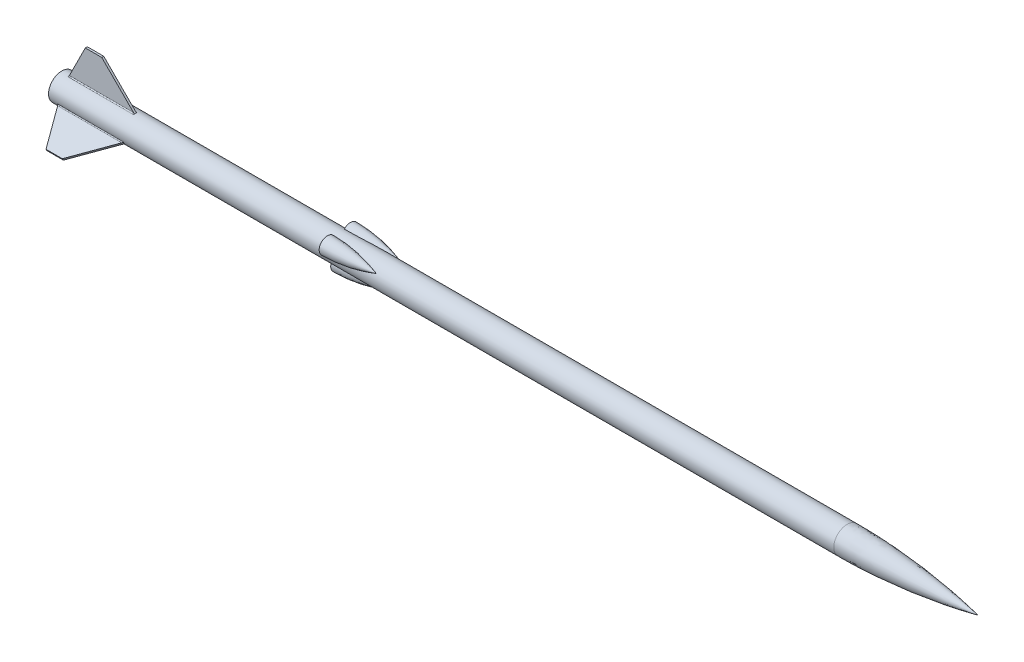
ISO-10303-21;
HEADER;
FILE_DESCRIPTION(('STEP AP214'),'2;1');
FILE_NAME('part.step','',(''),(''),'','','');
FILE_SCHEMA(('AUTOMOTIVE_DESIGN { 1 0 10303 214 1 1 1 1 }'));
ENDSEC;
DATA;
#1=APPLICATION_CONTEXT('core data for automotive mechanical design processes');
#2=APPLICATION_PROTOCOL_DEFINITION('international standard','automotive_design',2000,#1);
#3=PRODUCT_CONTEXT('',#1,'mechanical');
#4=PRODUCT('Part','Part','',(#3));
#5=PRODUCT_RELATED_PRODUCT_CATEGORY('part','',(#4));
#6=PRODUCT_DEFINITION_FORMATION('','',#4);
#7=PRODUCT_DEFINITION_CONTEXT('part definition',#1,'design');
#8=PRODUCT_DEFINITION('design','',#6,#7);
#9=PRODUCT_DEFINITION_SHAPE('','',#8);
#10=(LENGTH_UNIT() NAMED_UNIT(*) SI_UNIT(.MILLI.,.METRE.));
#11=(NAMED_UNIT(*) PLANE_ANGLE_UNIT() SI_UNIT($,.RADIAN.));
#12=(NAMED_UNIT(*) SI_UNIT($,.STERADIAN.) SOLID_ANGLE_UNIT());
#13=UNCERTAINTY_MEASURE_WITH_UNIT(LENGTH_MEASURE(1.E-05),#10,'distance_accuracy_value','');
#14=(GEOMETRIC_REPRESENTATION_CONTEXT(3) GLOBAL_UNCERTAINTY_ASSIGNED_CONTEXT((#13)) GLOBAL_UNIT_ASSIGNED_CONTEXT((#10,
#11,#12)) REPRESENTATION_CONTEXT('',''));
#15=CARTESIAN_POINT('',(0.,0.,0.));
#16=DIRECTION('',(0.,0.,1.));
#17=DIRECTION('',(1.,0.,0.));
#18=AXIS2_PLACEMENT_3D('',#15,#16,#17);
#19=CARTESIAN_POINT('',(406.4,0.,0.));
#20=DIRECTION('',(-1.,0.,0.));
#21=DIRECTION('',(0.,0.,1.));
#22=AXIS2_PLACEMENT_3D('',#19,#20,#21);
#23=CYLINDRICAL_SURFACE('',#22,6.8834);
#24=CARTESIAN_POINT('',(168.785993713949,3.44169999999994,5.96119926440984));
#25=CARTESIAN_POINT('',(168.785896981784,3.4417287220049,5.96118268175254));
#26=CARTESIAN_POINT('',(168.785800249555,3.44175744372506,5.9611660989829));
#27=CARTESIAN_POINT('',(168.785640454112,3.44180488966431,5.9611387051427));
#28=CARTESIAN_POINT('',(168.785577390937,3.44182361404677,5.96112789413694));
#29=CARTESIAN_POINT('',(168.785262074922,3.44191723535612,5.96107383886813));
#30=CARTESIAN_POINT('',(168.785009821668,3.44199213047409,5.96103059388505));
#31=CARTESIAN_POINT('',(168.783748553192,3.44236659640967,5.96081436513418));
#32=CARTESIAN_POINT('',(168.782739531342,3.44266613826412,5.9606413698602));
#33=CARTESIAN_POINT('',(168.77769438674,3.44416369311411,5.95977633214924));
#34=CARTESIAN_POINT('',(168.773658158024,3.4453612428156,5.95908410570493));
#35=CARTESIAN_POINT('',(168.753476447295,3.45134652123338,5.955621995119));
#36=CARTESIAN_POINT('',(168.737329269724,3.45612683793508,5.95284917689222));
#37=CARTESIAN_POINT('',(168.656584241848,3.47998896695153,5.93896961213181));
#38=CARTESIAN_POINT('',(168.591959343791,3.49895230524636,5.92781650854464));
#39=CARTESIAN_POINT('',(168.397994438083,3.55546591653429,5.89421573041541));
#40=CARTESIAN_POINT('',(168.26856841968,3.59263852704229,5.87162730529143));
#41=CARTESIAN_POINT('',(168.009492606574,3.66598503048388,5.82611462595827));
#42=CARTESIAN_POINT('',(167.879842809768,3.70215891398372,5.80319036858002));
#43=CARTESIAN_POINT('',(167.230810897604,3.88061636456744,5.68778779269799));
#44=CARTESIAN_POINT('',(166.709752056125,4.01547196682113,5.59308332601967));
#45=CARTESIAN_POINT('',(165.925737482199,4.20637406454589,5.44921641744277));
#46=CARTESIAN_POINT('',(165.663978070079,4.26811480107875,5.40095593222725));
#47=CARTESIAN_POINT('',(165.139669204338,4.38790678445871,5.30409299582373));
#48=CARTESIAN_POINT('',(164.877119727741,4.44595792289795,5.25549053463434));
#49=CARTESIAN_POINT('',(164.086206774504,4.61518804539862,5.10916313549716));
#50=CARTESIAN_POINT('',(163.55669586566,4.72092991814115,5.01131077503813));
#51=CARTESIAN_POINT('',(162.494848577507,4.91888350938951,4.81715702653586));
#52=CARTESIAN_POINT('',(161.962512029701,5.01109441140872,4.72085573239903));
#53=CARTESIAN_POINT('',(160.895155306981,5.18299099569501,4.53146316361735));
#54=CARTESIAN_POINT('',(160.360134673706,5.26267445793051,4.43837246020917));
#55=CARTESIAN_POINT('',(159.287708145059,5.41052074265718,4.25689558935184));
#56=CARTESIAN_POINT('',(158.750302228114,5.47868346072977,4.16850946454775));
#57=CARTESIAN_POINT('',(157.672501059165,5.60460715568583,3.99760658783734));
#58=CARTESIAN_POINT('',(157.132102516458,5.66235225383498,3.91509890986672));
#59=CARTESIAN_POINT('',(156.049338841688,5.76831589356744,3.75722850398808));
#60=CARTESIAN_POINT('',(155.506973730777,5.81653453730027,3.68186569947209));
#61=CARTESIAN_POINT('',(154.420459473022,5.90439981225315,3.53924780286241));
#62=CARTESIAN_POINT('',(153.876310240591,5.94404602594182,3.47199310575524));
#63=CARTESIAN_POINT('',(152.786447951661,6.01564313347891,3.34640974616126));
#64=CARTESIAN_POINT('',(152.240734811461,6.04759360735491,3.28808157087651));
#65=CARTESIAN_POINT('',(151.124345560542,6.10581442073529,3.17871537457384));
#66=CARTESIAN_POINT('',(150.553611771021,6.13177888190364,3.12810241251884));
#67=CARTESIAN_POINT('',(149.410987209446,6.17694132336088,3.03794892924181));
#68=CARTESIAN_POINT('',(148.839096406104,6.19613911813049,2.99840871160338));
#69=CARTESIAN_POINT('',(147.694403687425,6.22837312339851,2.93086424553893));
#70=CARTESIAN_POINT('',(147.121601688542,6.24140873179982,2.90286112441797));
#71=CARTESIAN_POINT('',(145.975442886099,6.26175015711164,2.8587185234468));
#72=CARTESIAN_POINT('',(145.402086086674,6.26905601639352,2.84257895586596));
#73=CARTESIAN_POINT('',(144.254731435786,6.27819413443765,2.82233904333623));
#74=CARTESIAN_POINT('',(143.68073341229,6.2800227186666,2.81824678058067));
#75=CARTESIAN_POINT('',(142.532786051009,6.27826040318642,2.82217051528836));
#76=CARTESIAN_POINT('',(141.958836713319,6.27466949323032,2.8301865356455));
#77=CARTESIAN_POINT('',(140.811311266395,6.26194210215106,2.85823608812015));
#78=CARTESIAN_POINT('',(140.237735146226,6.25280579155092,2.87826925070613));
#79=CARTESIAN_POINT('',(139.091240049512,6.22867414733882,2.93012474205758));
#80=CARTESIAN_POINT('',(138.518321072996,6.21367881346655,2.96194707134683));
#81=CARTESIAN_POINT('',(137.369666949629,6.17721725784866,3.03725928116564));
#82=CARTESIAN_POINT('',(136.793938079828,6.15570910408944,3.08082456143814));
#83=CARTESIAN_POINT('',(135.643733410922,6.10558611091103,3.17900146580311));
#84=CARTESIAN_POINT('',(135.069257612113,6.07697126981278,3.23361309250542));
#85=CARTESIAN_POINT('',(133.92183655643,6.01181114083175,3.3532011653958));
#86=CARTESIAN_POINT('',(133.348891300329,5.97526584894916,3.41817761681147));
#87=CARTESIAN_POINT('',(132.204797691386,5.89329083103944,3.55764811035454));
#88=CARTESIAN_POINT('',(131.633649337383,5.84786111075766,3.63214214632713));
#89=CARTESIAN_POINT('',(130.493736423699,5.74708706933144,3.78957995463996));
#90=CARTESIAN_POINT('',(129.92497066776,5.69174854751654,3.87251877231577));
#91=CARTESIAN_POINT('',(128.789740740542,5.57000504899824,4.04566840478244));
#92=CARTESIAN_POINT('',(128.223276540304,5.50360021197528,4.13587912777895));
#93=CARTESIAN_POINT('',(127.092812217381,5.3585309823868,4.32218732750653));
#94=CARTESIAN_POINT('',(126.528812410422,5.27986506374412,4.41828553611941));
#95=CARTESIAN_POINT('',(125.403558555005,5.10908232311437,4.614684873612));
#96=CARTESIAN_POINT('',(124.842304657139,5.01696477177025,4.71498623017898));
#97=CARTESIAN_POINT('',(124.282559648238,4.91752690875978,4.81654696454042));
#98=B_SPLINE_CURVE_WITH_KNOTS('',3,(#24,#25,#26,#27,#28,#29,#30,#31,#32,#33,#34,#35,#36,#37,#38,
#39,#40,#41,#42,#43,#44,#45,#46,#47,#48,#49,#50,#51,#52,#53,#54,#55,#56,#57,#58,#59,#60,#61,#62,
#63,#64,#65,#66,#67,#68,#69,#70,#71,#72,#73,#74,#75,#76,#77,#78,#79,#80,#81,#82,#83,#84,#85,#86,
#87,#88,#89,#90,#91,#92,#93,#94,#95,#96,#97),.UNSPECIFIED.,.F.,.F.,(4,2,2,2,2,2,2,2,2,2,2,2,2,2,
2,2,2,2,2,2,2,2,2,2,2,2,2,2,2,2,2,2,2,2,2,2,4),(0.,0.000306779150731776,0.000506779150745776,
0.00130677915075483,0.00450677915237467,0.0173067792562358,0.0685067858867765,0.273307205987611,
0.68292137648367,1.09253941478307,2.73172035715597,3.55141578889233,4.37113529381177,
6.01721296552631,7.66338992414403,9.30985827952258,10.9563415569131,12.6053136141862,
14.2542679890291,15.9033026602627,17.5524273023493,19.2729639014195,20.9935476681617,
22.7142995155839,24.4350386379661,26.1569318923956,27.8788284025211,29.6006719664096,
31.322515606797,33.0556897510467,34.7888643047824,36.5220397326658,38.2552140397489,
39.9873772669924,41.7195186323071,43.451875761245,45.184326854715),.UNSPECIFIED.);
#99=CARTESIAN_POINT('',(168.785993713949,3.44169999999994,5.96119926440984));
#100=VERTEX_POINT('',#99);
#101=CARTESIAN_POINT('',(143.385993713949,6.27935588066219,2.81973142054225));
#102=VERTEX_POINT('',#101);
#103=EDGE_CURVE('E336',#100,#102,#98,.T.);
#104=ORIENTED_EDGE('',*,*,#103,.F.);
#105=CARTESIAN_POINT('',(168.785993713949,3.44169999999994,5.96119926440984));
#106=CARTESIAN_POINT('',(168.785896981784,3.441671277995,5.96121584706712));
#107=CARTESIAN_POINT('',(168.785800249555,3.44164255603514,5.9612324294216));
#108=CARTESIAN_POINT('',(168.785640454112,3.44159510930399,5.9612598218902));
#109=CARTESIAN_POINT('',(168.785577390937,3.44157638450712,5.96127063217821));
#110=CARTESIAN_POINT('',(168.785262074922,3.44148276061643,5.96132468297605));
#111=CARTESIAN_POINT('',(168.785009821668,3.44140786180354,5.96136792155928));
#112=CARTESIAN_POINT('',(168.783748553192,3.44103336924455,5.96158410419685));
#113=CARTESIAN_POINT('',(168.782739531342,3.44073378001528,5.96175701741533));
#114=CARTESIAN_POINT('',(168.77769438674,3.43923585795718,5.96262141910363));
#115=CARTESIAN_POINT('',(168.773658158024,3.43803759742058,5.9633124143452));
#116=CARTESIAN_POINT('',(168.753476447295,3.43204668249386,5.96676476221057));
#117=CARTESIAN_POINT('',(168.737329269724,3.42725519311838,5.96951822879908));
#118=CARTESIAN_POINT('',(168.656584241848,3.40330407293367,5.98324365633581));
#119=CARTESIAN_POINT('',(168.591959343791,3.384163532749,5.99408983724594));
#120=CARTESIAN_POINT('',(168.397994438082,3.32680759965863,6.026231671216));
#121=CARTESIAN_POINT('',(168.26856841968,3.28865914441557,6.04712988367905));
#122=CARTESIAN_POINT('',(168.009492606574,3.2125707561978,6.08789347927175));
#123=CARTESIAN_POINT('',(167.879842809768,3.17463082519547,6.10775885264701));
#124=CARTESIAN_POINT('',(167.230810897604,2.98546053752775,6.20460625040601));
#125=CARTESIAN_POINT('',(166.709752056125,2.83601626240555,6.27404239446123));
#126=CARTESIAN_POINT('',(165.925737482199,2.61597281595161,6.36743500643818));
#127=CARTESIAN_POINT('',(165.663978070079,2.54330764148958,6.39677381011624));
#128=CARTESIAN_POINT('',(165.139669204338,2.39952588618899,6.45208524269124));
#129=CARTESIAN_POINT('',(164.877119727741,2.3284093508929,6.47805777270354));
#130=CARTESIAN_POINT('',(164.086206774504,2.11707104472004,6.55145165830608));
#131=CARTESIAN_POINT('',(163.55669586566,1.979457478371,6.59410062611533));
#132=CARTESIAN_POINT('',(162.494848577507,1.71233860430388,6.66845659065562));
#133=CARTESIAN_POINT('',(161.962512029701,1.58283378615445,6.70016292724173));
#134=CARTESIAN_POINT('',(160.895155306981,1.33286671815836,6.75433345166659));
#135=CARTESIAN_POINT('',(160.360134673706,1.21240607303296,6.77679600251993));
#136=CARTESIAN_POINT('',(159.287708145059,0.981319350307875,6.81409620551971));
#137=CARTESIAN_POINT('',(158.750302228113,0.870693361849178,6.82893378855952));
#138=CARTESIAN_POINT('',(157.672501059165,0.659725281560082,6.85253546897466));
#139=CARTESIAN_POINT('',(157.132102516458,0.559398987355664,6.86129035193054));
#140=CARTESIAN_POINT('',(156.049338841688,0.369697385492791,6.87412235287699));
#141=CARTESIAN_POINT('',(155.506973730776,0.280321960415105,6.87819952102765));
#142=CARTESIAN_POINT('',(154.420459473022,0.112878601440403,6.88298413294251));
#143=CARTESIAN_POINT('',(153.876310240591,0.0348112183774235,6.88369141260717));
#144=CARTESIAN_POINT('',(152.786447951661,-0.109745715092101,6.88290464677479));
#145=CARTESIAN_POINT('',(152.240734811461,-0.17623463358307,6.88141048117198));
#146=CARTESIAN_POINT('',(151.124345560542,-0.30005894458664,6.87714808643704));
#147=CARTESIAN_POINT('',(150.553611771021,-0.356873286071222,6.8743274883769));
#148=CARTESIAN_POINT('',(149.410987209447,-0.45752971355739,6.86836256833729));
#149=CARTESIAN_POINT('',(148.839096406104,-0.501371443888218,6.8652182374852));
#150=CARTESIAN_POINT('',(147.694403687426,-0.575983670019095,6.8593614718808));
#151=CARTESIAN_POINT('',(147.121601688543,-0.606752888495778,6.85664907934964));
#152=CARTESIAN_POINT('',(145.9754428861,-0.655152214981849,6.85219396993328));
#153=CARTESIAN_POINT('',(145.402086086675,-0.672782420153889,6.85045124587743));
#154=CARTESIAN_POINT('',(144.254731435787,-0.694879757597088,6.84824513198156));
#155=CARTESIAN_POINT('',(143.680733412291,-0.699338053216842,6.84778260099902));
#156=CARTESIAN_POINT('',(142.532786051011,-0.695058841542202,6.84821825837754));
#157=CARTESIAN_POINT('',(141.958836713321,-0.686321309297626,6.84911644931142));
#158=CARTESIAN_POINT('',(140.811311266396,-0.655665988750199,6.85211898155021));
#159=CARTESIAN_POINT('',(140.237735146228,-0.633748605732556,6.85422328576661));
#160=CARTESIAN_POINT('',(139.091240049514,-0.576774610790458,6.85925241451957));
#161=CARTESIAN_POINT('',(138.518321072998,-0.541717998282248,6.86217723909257));
#162=CARTESIAN_POINT('',(137.369666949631,-0.458264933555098,6.86825671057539));
#163=CARTESIAN_POINT('',(136.79393807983,-0.409782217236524,6.87141274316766));
#164=CARTESIAN_POINT('',(135.643733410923,-0.299697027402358,6.87709340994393));
#165=CARTESIAN_POINT('',(135.069257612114,-0.238094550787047,6.87961804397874));
#166=CARTESIAN_POINT('',(133.921836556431,-0.101948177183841,6.8829817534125));
#167=CARTESIAN_POINT('',(133.34889130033,-0.0274042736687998,6.8838208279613));
#168=CARTESIAN_POINT('',(132.204797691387,0.134368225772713,6.88256362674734));
#169=CARTESIAN_POINT('',(131.633649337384,0.221596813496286,6.88046735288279));
#170=CARTESIAN_POINT('',(130.4937364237,0.408328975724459,6.87191337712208));
#171=CARTESIAN_POINT('',(129.924970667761,0.50782535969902,6.86545822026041));
#172=CARTESIAN_POINT('',(128.789740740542,0.718649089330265,6.84660007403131));
#173=CARTESIAN_POINT('',(128.223276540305,0.829976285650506,6.83419715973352));
#174=CARTESIAN_POINT('',(127.092812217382,1.0638585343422,6.80171762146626));
#175=CARTESIAN_POINT('',(126.528812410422,1.18641498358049,6.78164004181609));
#176=CARTESIAN_POINT('',(125.403558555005,1.44189316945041,6.7319375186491));
#177=CARTESIAN_POINT('',(124.842304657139,1.57481546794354,6.70231205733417));
#178=CARTESIAN_POINT('',(124.282559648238,1.7124885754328,6.66697670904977));
#179=B_SPLINE_CURVE_WITH_KNOTS('',3,(#105,#106,#107,#108,#109,#110,#111,#112,#113,#114,#115,
#116,#117,#118,#119,#120,#121,#122,#123,#124,#125,#126,#127,#128,#129,#130,#131,#132,#133,#134,
#135,#136,#137,#138,#139,#140,#141,#142,#143,#144,#145,#146,#147,#148,#149,#150,#151,#152,#153,
#154,#155,#156,#157,#158,#159,#160,#161,#162,#163,#164,#165,#166,#167,#168,#169,#170,#171,#172,
#173,#174,#175,#176,#177,#178),.UNSPECIFIED.,.F.,.F.,(4,2,2,2,2,2,2,2,2,2,2,2,2,2,2,2,2,2,2,2,2,
2,2,2,2,2,2,2,2,2,2,2,2,2,2,2,4),(0.,0.000306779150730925,0.000506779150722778,
0.00130677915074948,0.00450677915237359,0.0173067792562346,0.0685067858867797,0.27330720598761,
0.682921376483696,1.09253941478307,2.73172035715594,3.55141578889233,4.37113529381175,
6.0172129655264,7.66338992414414,9.30985827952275,10.9563415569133,12.6053136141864,
14.2542679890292,15.9033026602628,17.5524273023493,19.2729639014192,20.9935476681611,
22.7142995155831,24.435038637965,26.1569318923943,27.8788284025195,29.6006719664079,
31.3225156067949,33.0556897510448,34.7888643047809,36.5220397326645,38.2552140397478,
39.9873772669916,41.7195186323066,43.4518757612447,45.1843268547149),.UNSPECIFIED.);
#180=CARTESIAN_POINT('',(143.385993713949,-0.697718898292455,6.84794742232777));
#181=VERTEX_POINT('',#180);
#182=EDGE_CURVE('E341',#181,#100,#179,.F.);
#183=ORIENTED_EDGE('',*,*,#182,.F.);
#184=CARTESIAN_POINT('',(143.385993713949,0.,0.));
#185=DIRECTION('',(1.,0.,0.));
#186=DIRECTION('',(0.,0.,-1.));
#187=AXIS2_PLACEMENT_3D('',#184,#185,#186);
#188=CIRCLE('',#187,6.8834);
#189=EDGE_CURVE('E756',#102,#181,#188,.T.);
#190=ORIENTED_EDGE('',*,*,#189,.F.);
#191=EDGE_LOOP('',(#104,#183,#190));
#192=FACE_BOUND('',#191,.T.);
#193=CARTESIAN_POINT('',(168.785993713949,-6.8834,0.));
#194=CARTESIAN_POINT('',(168.785896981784,-6.8834,3.31653145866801E-05));
#195=CARTESIAN_POINT('',(168.785800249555,-6.88339999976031,6.63304387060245E-05));
#196=CARTESIAN_POINT('',(168.785640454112,-6.8833999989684,0.000121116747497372));
#197=CARTESIAN_POINT('',(168.785577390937,-6.88339999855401,0.000142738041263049));
#198=CARTESIAN_POINT('',(168.785262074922,-6.88339999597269,0.00025084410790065));
#199=CARTESIAN_POINT('',(168.785009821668,-6.88339999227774,0.000337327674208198));
#200=CARTESIAN_POINT('',(168.783748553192,-6.88339996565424,0.000769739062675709));
#201=CARTESIAN_POINT('',(168.782739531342,-6.88339991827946,0.00111564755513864));
#202=CARTESIAN_POINT('',(168.77769438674,-6.88339955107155,0.00284508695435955));
#203=CARTESIAN_POINT('',(168.773658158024,-6.88339884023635,0.00422830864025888));
#204=CARTESIAN_POINT('',(168.753476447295,-6.8833932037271,0.0111427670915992));
#205=CARTESIAN_POINT('',(168.737329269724,-6.88338203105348,0.0166690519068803));
#206=CARTESIAN_POINT('',(168.656584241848,-6.88329303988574,0.0442740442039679));
#207=CARTESIAN_POINT('',(168.591959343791,-6.88311583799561,0.0662733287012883));
#208=CARTESIAN_POINT('',(168.397994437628,-6.88227351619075,0.132015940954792));
#209=CARTESIAN_POINT('',(168.26856841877,-6.88129767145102,0.175502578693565));
#210=CARTESIAN_POINT('',(168.009492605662,-6.87855578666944,0.261778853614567));
#211=CARTESIAN_POINT('',(167.879842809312,-6.87678973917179,0.304568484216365));
#212=CARTESIAN_POINT('',(167.230810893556,-6.86607690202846,0.516818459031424));
#213=CARTESIAN_POINT('',(166.709752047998,-6.85148822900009,0.680959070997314));
#214=CARTESIAN_POINT('',(165.925737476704,-6.82234688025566,0.918218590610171));
#215=CARTESIAN_POINT('',(165.663978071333,-6.81142244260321,0.995817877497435));
#216=CARTESIAN_POINT('',(165.139669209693,-6.78743267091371,1.14799224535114));
#217=CARTESIAN_POINT('',(164.87711973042,-6.77436727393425,1.22256723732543));
#218=CARTESIAN_POINT('',(164.086207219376,-6.73225911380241,1.4422883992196));
#219=CARTESIAN_POINT('',(163.556696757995,-6.70038745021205,1.58278961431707));
#220=CARTESIAN_POINT('',(162.494850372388,-6.63122223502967,1.85129912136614));
#221=CARTESIAN_POINT('',(161.962514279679,-6.59392835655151,1.97930665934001));
#222=CARTESIAN_POINT('',(160.895158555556,-6.51585795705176,2.22286956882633));
#223=CARTESIAN_POINT('',(160.360138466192,-6.47508082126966,2.33842273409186));
#224=CARTESIAN_POINT('',(159.287713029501,-6.39184047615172,2.55719965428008));
#225=CARTESIAN_POINT('',(158.750307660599,-6.34937725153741,2.66042329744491));
#226=CARTESIAN_POINT('',(157.672506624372,-6.26433287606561,2.85492792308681));
#227=CARTESIAN_POINT('',(157.132107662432,-6.22175164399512,2.94619059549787));
#228=CARTESIAN_POINT('',(156.049343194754,-6.13801361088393,3.11689319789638));
#229=CARTESIAN_POINT('',(155.506977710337,-6.09685679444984,3.19633325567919));
#230=CARTESIAN_POINT('',(154.420462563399,-6.01727863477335,3.34373593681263));
#231=CARTESIAN_POINT('',(153.876312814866,-5.97885742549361,3.4116979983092));
#232=CARTESIAN_POINT('',(152.786449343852,-5.9058975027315,3.53649475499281));
#233=CARTESIAN_POINT('',(152.240735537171,-5.87135900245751,3.5933288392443));
#234=CARTESIAN_POINT('',(151.122689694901,-5.80565818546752,3.69858860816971));
#235=CARTESIAN_POINT('',(150.550295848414,-5.77472643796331,3.74650270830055));
#236=CARTESIAN_POINT('',(149.404345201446,-5.71910729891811,3.8308694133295));
#237=CARTESIAN_POINT('',(148.830788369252,-5.69442008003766,3.86732170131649));
#238=CARTESIAN_POINT('',(147.682759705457,-5.65199909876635,3.92905912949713));
#239=CARTESIAN_POINT('',(147.108287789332,-5.63426602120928,3.95434316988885));
#240=CARTESIAN_POINT('',(145.958788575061,-5.60625583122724,3.99395543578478));
#241=CARTESIAN_POINT('',(145.383761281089,-5.59597866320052,4.00828374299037));
#242=CARTESIAN_POINT('',(144.233062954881,-5.5831607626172,4.02611878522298));
#243=CARTESIAN_POINT('',(143.657391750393,-5.58062527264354,4.02961818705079));
#244=CARTESIAN_POINT('',(142.506102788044,-5.58337554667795,4.02580656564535));
#245=CARTESIAN_POINT('',(141.930485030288,-5.58866132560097,4.01849552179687));
#246=CARTESIAN_POINT('',(140.7796302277,-5.60690781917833,3.992997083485));
#247=CARTESIAN_POINT('',(140.204393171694,-5.61986829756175,3.97481002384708));
#248=CARTESIAN_POINT('',(139.054586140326,-5.65310256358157,3.92739917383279));
#249=CARTESIAN_POINT('',(138.480016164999,-5.67337635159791,3.89817538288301));
#250=CARTESIAN_POINT('',(137.328027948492,-5.72081926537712,3.82821371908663));
#251=CARTESIAN_POINT('',(136.750616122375,-5.7480332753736,3.78740069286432));
#252=CARTESIAN_POINT('',(135.597060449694,-5.80848664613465,3.6940182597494));
#253=CARTESIAN_POINT('',(135.020916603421,-5.84172600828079,3.64144885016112));
#254=CARTESIAN_POINT('',(133.870176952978,-5.91321316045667,3.52417655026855));
#255=CARTESIAN_POINT('',(133.29558114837,-5.95146094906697,3.45947366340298));
#256=CARTESIAN_POINT('',(132.148205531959,-6.03173707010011,3.31752769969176));
#257=CARTESIAN_POINT('',(131.575425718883,-6.07376539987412,3.24028463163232));
#258=CARTESIAN_POINT('',(130.432274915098,-6.16014285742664,3.07289768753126));
#259=CARTESIAN_POINT('',(129.861902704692,-6.20449060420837,2.98276143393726));
#260=CARTESIAN_POINT('',(128.723482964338,-6.29388957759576,2.78917715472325));
#261=CARTESIAN_POINT('',(128.155435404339,-6.33894079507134,2.6857293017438));
#262=CARTESIAN_POINT('',(127.021826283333,-6.42792685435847,2.46518058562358));
#263=CARTESIAN_POINT('',(126.45626505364,-6.47186155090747,2.34807795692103));
#264=CARTESIAN_POINT('',(125.327914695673,-6.55653372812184,2.1000338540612));
#265=CARTESIAN_POINT('',(124.765125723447,-6.59727103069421,1.96909160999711));
#266=CARTESIAN_POINT('',(124.203860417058,-6.63536962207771,1.83113777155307));
#267=B_SPLINE_CURVE_WITH_KNOTS('',3,(#193,#194,#195,#196,#197,#198,#199,#200,#201,#202,#203,
#204,#205,#206,#207,#208,#209,#210,#211,#212,#213,#214,#215,#216,#217,#218,#219,#220,#221,#222,
#223,#224,#225,#226,#227,#228,#229,#230,#231,#232,#233,#234,#235,#236,#237,#238,#239,#240,#241,
#242,#243,#244,#245,#246,#247,#248,#249,#250,#251,#252,#253,#254,#255,#256,#257,#258,#259,#260,
#261,#262,#263,#264,#265,#266),.UNSPECIFIED.,.F.,.F.,(4,2,2,2,2,2,2,2,2,2,2,2,2,2,2,2,2,2,2,2,2,
2,2,2,2,2,2,2,2,2,2,2,2,2,2,2,4),(0.,0.000306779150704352,0.000506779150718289,
0.00130677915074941,0.00450677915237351,0.0173067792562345,0.0685067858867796,0.273307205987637,
0.682921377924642,1.0925394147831,2.73172036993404,3.55141578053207,4.37113529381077,
6.01721157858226,7.66338714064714,9.30985383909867,10.9563354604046,12.6053088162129,
14.2542643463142,15.9033005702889,17.552427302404,19.2779617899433,21.0035439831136,
22.7292960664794,24.4550352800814,26.1819428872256,27.9088537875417,29.6357115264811,
31.3625693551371,33.1008917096,34.8392144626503,36.5775367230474,38.3158577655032,
40.0531553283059,41.7904303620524,43.5279302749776,45.2655268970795),.UNSPECIFIED.);
#268=CARTESIAN_POINT('',(168.785993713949,-6.8834,0.));
#269=VERTEX_POINT('',#268);
#270=CARTESIAN_POINT('',(143.385993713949,-5.58163698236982,4.02821600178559));
#271=VERTEX_POINT('',#270);
#272=EDGE_CURVE('E593',#269,#271,#267,.T.);
#273=ORIENTED_EDGE('',*,*,#272,.F.);
#274=CARTESIAN_POINT('',(168.785993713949,-6.8834,0.));
#275=CARTESIAN_POINT('',(168.785896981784,-6.8834,-3.31653145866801E-05));
#276=CARTESIAN_POINT('',(168.785800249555,-6.88339999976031,-6.63304387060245E-05));
#277=CARTESIAN_POINT('',(168.785640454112,-6.8833999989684,-0.000121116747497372));
#278=CARTESIAN_POINT('',(168.785577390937,-6.88339999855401,-0.000142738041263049));
#279=CARTESIAN_POINT('',(168.785262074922,-6.88339999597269,-0.00025084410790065));
#280=CARTESIAN_POINT('',(168.785009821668,-6.88339999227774,-0.000337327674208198));
#281=CARTESIAN_POINT('',(168.783748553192,-6.88339996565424,-0.000769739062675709));
#282=CARTESIAN_POINT('',(168.782739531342,-6.88339991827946,-0.00111564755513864));
#283=CARTESIAN_POINT('',(168.77769438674,-6.88339955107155,-0.00284508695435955));
#284=CARTESIAN_POINT('',(168.773658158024,-6.88339884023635,-0.00422830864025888));
#285=CARTESIAN_POINT('',(168.753476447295,-6.8833932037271,-0.0111427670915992));
#286=CARTESIAN_POINT('',(168.737329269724,-6.88338203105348,-0.0166690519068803));
#287=CARTESIAN_POINT('',(168.656584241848,-6.88329303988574,-0.0442740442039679));
#288=CARTESIAN_POINT('',(168.591959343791,-6.88311583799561,-0.0662733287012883));
#289=CARTESIAN_POINT('',(168.397994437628,-6.88227351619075,-0.132015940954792));
#290=CARTESIAN_POINT('',(168.26856841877,-6.88129767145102,-0.175502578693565));
#291=CARTESIAN_POINT('',(168.009492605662,-6.87855578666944,-0.261778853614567));
#292=CARTESIAN_POINT('',(167.879842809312,-6.87678973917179,-0.304568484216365));
#293=CARTESIAN_POINT('',(167.230810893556,-6.86607690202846,-0.516818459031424));
#294=CARTESIAN_POINT('',(166.709752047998,-6.85148822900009,-0.680959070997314));
#295=CARTESIAN_POINT('',(165.925737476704,-6.82234688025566,-0.918218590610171));
#296=CARTESIAN_POINT('',(165.663978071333,-6.81142244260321,-0.995817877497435));
#297=CARTESIAN_POINT('',(165.139669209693,-6.78743267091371,-1.14799224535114));
#298=CARTESIAN_POINT('',(164.87711973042,-6.77436727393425,-1.22256723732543));
#299=CARTESIAN_POINT('',(164.086207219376,-6.73225911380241,-1.4422883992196));
#300=CARTESIAN_POINT('',(163.556696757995,-6.70038745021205,-1.58278961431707));
#301=CARTESIAN_POINT('',(162.494850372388,-6.63122223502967,-1.85129912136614));
#302=CARTESIAN_POINT('',(161.962514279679,-6.59392835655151,-1.97930665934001));
#303=CARTESIAN_POINT('',(160.895158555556,-6.51585795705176,-2.22286956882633));
#304=CARTESIAN_POINT('',(160.360138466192,-6.47508082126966,-2.33842273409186));
#305=CARTESIAN_POINT('',(159.287713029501,-6.39184047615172,-2.55719965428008));
#306=CARTESIAN_POINT('',(158.750307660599,-6.34937725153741,-2.66042329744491));
#307=CARTESIAN_POINT('',(157.672506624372,-6.26433287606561,-2.85492792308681));
#308=CARTESIAN_POINT('',(157.132107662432,-6.22175164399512,-2.94619059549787));
#309=CARTESIAN_POINT('',(156.049343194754,-6.13801361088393,-3.11689319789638));
#310=CARTESIAN_POINT('',(155.506977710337,-6.09685679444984,-3.19633325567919));
#311=CARTESIAN_POINT('',(154.420462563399,-6.01727863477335,-3.34373593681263));
#312=CARTESIAN_POINT('',(153.876312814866,-5.97885742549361,-3.41169799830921));
#313=CARTESIAN_POINT('',(152.786449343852,-5.9058975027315,-3.53649475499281));
#314=CARTESIAN_POINT('',(152.240735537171,-5.87135900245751,-3.5933288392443));
#315=CARTESIAN_POINT('',(151.122689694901,-5.80565818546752,-3.69858860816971));
#316=CARTESIAN_POINT('',(150.550295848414,-5.77472643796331,-3.74650270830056));
#317=CARTESIAN_POINT('',(149.404345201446,-5.7191072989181,-3.8308694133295));
#318=CARTESIAN_POINT('',(148.830788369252,-5.69442008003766,-3.8673217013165));
#319=CARTESIAN_POINT('',(147.682759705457,-5.65199909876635,-3.92905912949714));
#320=CARTESIAN_POINT('',(147.108287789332,-5.63426602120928,-3.95434316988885));
#321=CARTESIAN_POINT('',(145.958788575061,-5.60625583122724,-3.99395543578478));
#322=CARTESIAN_POINT('',(145.383761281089,-5.59597866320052,-4.00828374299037));
#323=CARTESIAN_POINT('',(144.233062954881,-5.5831607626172,-4.02611878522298));
#324=CARTESIAN_POINT('',(143.657391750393,-5.58062527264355,-4.02961818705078));
#325=CARTESIAN_POINT('',(142.506102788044,-5.58337554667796,-4.02580656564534));
#326=CARTESIAN_POINT('',(141.930485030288,-5.58866132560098,-4.01849552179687));
#327=CARTESIAN_POINT('',(140.7796302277,-5.60690781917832,-3.99299708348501));
#328=CARTESIAN_POINT('',(140.204393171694,-5.61986829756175,-3.97481002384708));
#329=CARTESIAN_POINT('',(139.054586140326,-5.65310256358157,-3.92739917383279));
#330=CARTESIAN_POINT('',(138.480016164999,-5.67337635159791,-3.89817538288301));
#331=CARTESIAN_POINT('',(137.328027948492,-5.72081926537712,-3.82821371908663));
#332=CARTESIAN_POINT('',(136.750616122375,-5.7480332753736,-3.78740069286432));
#333=CARTESIAN_POINT('',(135.597060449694,-5.80848664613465,-3.6940182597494));
#334=CARTESIAN_POINT('',(135.020916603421,-5.84172600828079,-3.64144885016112));
#335=CARTESIAN_POINT('',(133.870176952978,-5.91321316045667,-3.52417655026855));
#336=CARTESIAN_POINT('',(133.29558114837,-5.95146094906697,-3.45947366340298));
#337=CARTESIAN_POINT('',(132.148205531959,-6.03173707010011,-3.31752769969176));
#338=CARTESIAN_POINT('',(131.575425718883,-6.07376539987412,-3.24028463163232));
#339=CARTESIAN_POINT('',(130.432274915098,-6.16014285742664,-3.07289768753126));
#340=CARTESIAN_POINT('',(129.861902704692,-6.20449060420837,-2.98276143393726));
#341=CARTESIAN_POINT('',(128.723482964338,-6.29388957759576,-2.78917715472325));
#342=CARTESIAN_POINT('',(128.155435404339,-6.33894079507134,-2.6857293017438));
#343=CARTESIAN_POINT('',(127.021826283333,-6.42792685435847,-2.46518058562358));
#344=CARTESIAN_POINT('',(126.45626505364,-6.47186155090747,-2.34807795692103));
#345=CARTESIAN_POINT('',(125.327914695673,-6.55653372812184,-2.1000338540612));
#346=CARTESIAN_POINT('',(124.765125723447,-6.59727103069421,-1.96909160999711));
#347=CARTESIAN_POINT('',(124.203860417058,-6.63536962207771,-1.83113777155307));
#348=B_SPLINE_CURVE_WITH_KNOTS('',3,(#274,#275,#276,#277,#278,#279,#280,#281,#282,#283,#284,
#285,#286,#287,#288,#289,#290,#291,#292,#293,#294,#295,#296,#297,#298,#299,#300,#301,#302,#303,
#304,#305,#306,#307,#308,#309,#310,#311,#312,#313,#314,#315,#316,#317,#318,#319,#320,#321,#322,
#323,#324,#325,#326,#327,#328,#329,#330,#331,#332,#333,#334,#335,#336,#337,#338,#339,#340,#341,
#342,#343,#344,#345,#346,#347),.UNSPECIFIED.,.F.,.F.,(4,2,2,2,2,2,2,2,2,2,2,2,2,2,2,2,2,2,2,2,2,
2,2,2,2,2,2,2,2,2,2,2,2,2,2,2,4),(0.,0.000306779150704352,0.000506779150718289,
0.00130677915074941,0.00450677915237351,0.0173067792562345,0.0685067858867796,0.273307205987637,
0.682921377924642,1.0925394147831,2.73172036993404,3.55141578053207,4.37113529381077,
6.01721157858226,7.66338714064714,9.30985383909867,10.9563354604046,12.6053088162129,
14.2542643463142,15.9033005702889,17.552427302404,19.2779617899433,21.0035439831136,
22.7292960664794,24.4550352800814,26.1819428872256,27.9088537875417,29.6357115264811,
31.3625693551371,33.1008917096,34.8392144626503,36.5775367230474,38.3158577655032,
40.0531553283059,41.7904303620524,43.5279302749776,45.2655268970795),.UNSPECIFIED.);
#349=CARTESIAN_POINT('',(143.385993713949,-5.58163698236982,-4.02821600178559));
#350=VERTEX_POINT('',#349);
#351=EDGE_CURVE('E586',#350,#269,#348,.F.);
#352=ORIENTED_EDGE('',*,*,#351,.F.);
#353=CARTESIAN_POINT('',(143.385993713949,0.,0.));
#354=DIRECTION('',(1.,0.,0.));
#355=DIRECTION('',(0.,0.,-1.));
#356=AXIS2_PLACEMENT_3D('',#353,#354,#355);
#357=CIRCLE('',#356,6.8834);
#358=EDGE_CURVE('E583',#271,#350,#357,.T.);
#359=ORIENTED_EDGE('',*,*,#358,.F.);
#360=EDGE_LOOP('',(#273,#352,#359));
#361=FACE_BOUND('',#360,.T.);
#362=CARTESIAN_POINT('',(4.23333333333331,0.,0.));
#363=DIRECTION('',(1.,0.,0.));
#364=DIRECTION('',(0.,0.,-1.));
#365=AXIS2_PLACEMENT_3D('',#362,#363,#364);
#366=CIRCLE('',#365,6.8834);
#367=CARTESIAN_POINT('',(4.23333333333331,-4.25755367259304,-5.40873666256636));
#368=VERTEX_POINT('',#367);
#369=CARTESIAN_POINT('',(4.23333333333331,-3.86953258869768,-5.692794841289));
#370=VERTEX_POINT('',#369);
#371=EDGE_CURVE('E573',#368,#370,#366,.T.);
#372=ORIENTED_EDGE('',*,*,#371,.F.);
#373=DIRECTION('',(-1.,0.,0.));
#374=VECTOR('',#373,1.);
#375=CARTESIAN_POINT('',(406.4,-4.25755367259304,-5.40873666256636));
#376=LINE('',#375,#374);
#377=CARTESIAN_POINT('',(38.1,-4.25755367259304,-5.40873666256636));
#378=VERTEX_POINT('',#377);
#379=EDGE_CURVE('E433',#368,#378,#376,.F.);
#380=ORIENTED_EDGE('',*,*,#379,.T.);
#381=CARTESIAN_POINT('',(38.1,0.,0.));
#382=DIRECTION('',(-1.,0.,0.));
#383=DIRECTION('',(0.,0.,1.));
#384=AXIS2_PLACEMENT_3D('',#381,#382,#383);
#385=CIRCLE('',#384,6.8834);
#386=CARTESIAN_POINT('',(38.1,-3.8695330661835,-5.69279451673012));
#387=VERTEX_POINT('',#386);
#388=EDGE_CURVE('E443',#387,#378,#385,.T.);
#389=ORIENTED_EDGE('',*,*,#388,.F.);
#390=CARTESIAN_POINT('',(44.9648712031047,0.,0.));
#391=DIRECTION('',(-0.707106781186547,0.353553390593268,0.612372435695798));
#392=DIRECTION('',(-0.707106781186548,-0.353553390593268,-0.612372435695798));
#393=AXIS2_PLACEMENT_3D('',#390,#391,#392);
#394=ELLIPSE('',#393,9.73459763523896,6.8834);
#395=CARTESIAN_POINT('',(38.1,-2.99533813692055,-6.19751119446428));
#396=VERTEX_POINT('',#395);
#397=EDGE_CURVE('E581',#396,#387,#394,.T.);
#398=ORIENTED_EDGE('',*,*,#397,.F.);
#399=CARTESIAN_POINT('',(38.1,-2.55532651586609,-6.39151796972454));
#400=VERTEX_POINT('',#399);
#401=EDGE_CURVE('E580',#400,#396,#385,.T.);
#402=ORIENTED_EDGE('',*,*,#401,.F.);
#403=DIRECTION('',(-1.,0.,0.));
#404=VECTOR('',#403,1.);
#405=CARTESIAN_POINT('',(406.4,-2.55532651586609,-6.39151796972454));
#406=LINE('',#405,#404);
#407=CARTESIAN_POINT('',(4.23333333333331,-2.55532651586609,-6.39151796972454));
#408=VERTEX_POINT('',#407);
#409=EDGE_CURVE('E398',#400,#408,#406,.T.);
#410=ORIENTED_EDGE('',*,*,#409,.T.);
#411=CARTESIAN_POINT('',(4.23333333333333,-2.99533865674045,-6.19751094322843));
#412=VERTEX_POINT('',#411);
#413=EDGE_CURVE('E576',#412,#408,#366,.T.);
#414=ORIENTED_EDGE('',*,*,#413,.F.);
#415=CARTESIAN_POINT('',(0.800897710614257,0.,0.));
#416=DIRECTION('',(0.894427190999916,0.223606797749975,0.387298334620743));
#417=DIRECTION('',(-0.447213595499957,0.447213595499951,0.774596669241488));
#418=AXIS2_PLACEMENT_3D('',#415,#416,#417);
#419=ELLIPSE('',#418,7.69587515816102,6.8834);
#420=EDGE_CURVE('E575',#370,#412,#419,.T.);
#421=ORIENTED_EDGE('',*,*,#420,.F.);
#422=EDGE_LOOP('',(#372,#380,#389,#398,#402,#410,#414,#421));
#423=FACE_BOUND('',#422,.T.);
#424=DIRECTION('',(-1.,0.,0.));
#425=VECTOR('',#424,1.);
#426=CARTESIAN_POINT('',(406.4,-4.25755367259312,5.4087366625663));
#427=LINE('',#426,#425);
#428=CARTESIAN_POINT('',(38.1,-4.25755367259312,5.4087366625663));
#429=VERTEX_POINT('',#428);
#430=CARTESIAN_POINT('',(4.23333333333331,-4.25755367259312,5.4087366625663));
#431=VERTEX_POINT('',#430);
#432=EDGE_CURVE('E414',#429,#431,#427,.T.);
#433=ORIENTED_EDGE('',*,*,#432,.T.);
#434=CARTESIAN_POINT('',(4.23333333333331,0.,0.));
#435=DIRECTION('',(1.,0.,0.));
#436=DIRECTION('',(0.,0.,-1.));
#437=AXIS2_PLACEMENT_3D('',#434,#435,#436);
#438=CIRCLE('',#437,6.8834);
#439=CARTESIAN_POINT('',(4.23333333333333,-3.86953258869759,5.69279484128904));
#440=VERTEX_POINT('',#439);
#441=EDGE_CURVE('E564',#440,#431,#438,.T.);
#442=ORIENTED_EDGE('',*,*,#441,.F.);
#443=CARTESIAN_POINT('',(0.800897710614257,0.,0.));
#444=DIRECTION('',(0.894427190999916,0.22360679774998,-0.38729833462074));
#445=DIRECTION('',(-0.447213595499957,0.447213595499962,-0.774596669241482));
#446=AXIS2_PLACEMENT_3D('',#443,#444,#445);
#447=ELLIPSE('',#446,7.69587515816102,6.8834);
#448=CARTESIAN_POINT('',(4.23333333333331,-2.9953386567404,6.19751094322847));
#449=VERTEX_POINT('',#448);
#450=EDGE_CURVE('E563',#449,#440,#447,.T.);
#451=ORIENTED_EDGE('',*,*,#450,.F.);
#452=CARTESIAN_POINT('',(4.23333333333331,-2.55532651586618,6.3915179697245));
#453=VERTEX_POINT('',#452);
#454=EDGE_CURVE('E560',#453,#449,#438,.T.);
#455=ORIENTED_EDGE('',*,*,#454,.F.);
#456=DIRECTION('',(-1.,0.,0.));
#457=VECTOR('',#456,1.);
#458=CARTESIAN_POINT('',(406.4,-2.55532651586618,6.3915179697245));
#459=LINE('',#458,#457);
#460=CARTESIAN_POINT('',(38.1,-2.55532651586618,6.3915179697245));
#461=VERTEX_POINT('',#460);
#462=EDGE_CURVE('E351',#453,#461,#459,.F.);
#463=ORIENTED_EDGE('',*,*,#462,.T.);
#464=CARTESIAN_POINT('',(38.1,0.,0.));
#465=DIRECTION('',(-1.,0.,0.));
#466=DIRECTION('',(0.,0.,1.));
#467=AXIS2_PLACEMENT_3D('',#464,#465,#466);
#468=CIRCLE('',#467,6.8834);
#469=CARTESIAN_POINT('',(38.1,-2.99533813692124,6.19751119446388));
#470=VERTEX_POINT('',#469);
#471=EDGE_CURVE('E567',#470,#461,#468,.T.);
#472=ORIENTED_EDGE('',*,*,#471,.F.);
#473=CARTESIAN_POINT('',(44.9648712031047,0.,0.));
#474=DIRECTION('',(-0.707106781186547,0.353553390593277,-0.612372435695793));
#475=DIRECTION('',(-0.707106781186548,-0.353553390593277,0.612372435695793));
#476=AXIS2_PLACEMENT_3D('',#473,#474,#475);
#477=ELLIPSE('',#476,9.73459763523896,6.8834);
#478=CARTESIAN_POINT('',(38.1,-3.86953306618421,5.69279451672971));
#479=VERTEX_POINT('',#478);
#480=EDGE_CURVE('E570',#479,#470,#477,.T.);
#481=ORIENTED_EDGE('',*,*,#480,.F.);
#482=EDGE_CURVE('E569',#429,#479,#468,.T.);
#483=ORIENTED_EDGE('',*,*,#482,.F.);
#484=EDGE_LOOP('',(#433,#442,#451,#455,#463,#472,#481,#483));
#485=FACE_BOUND('',#484,.T.);
#486=CARTESIAN_POINT('',(4.23333333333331,0.,0.));
#487=DIRECTION('',(1.,0.,0.));
#488=DIRECTION('',(0.,0.,-1.));
#489=AXIS2_PLACEMENT_3D('',#486,#487,#488);
#490=CIRCLE('',#489,6.8834);
#491=CARTESIAN_POINT('',(4.23333333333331,6.81288018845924,-0.982781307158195));
#492=VERTEX_POINT('',#491);
#493=CARTESIAN_POINT('',(4.23333333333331,6.86487124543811,-0.504716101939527));
#494=VERTEX_POINT('',#493);
#495=EDGE_CURVE('E547',#492,#494,#490,.T.);
#496=ORIENTED_EDGE('',*,*,#495,.F.);
#497=DIRECTION('',(-1.,0.,0.));
#498=VECTOR('',#497,1.);
#499=CARTESIAN_POINT('',(406.4,6.81288018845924,-0.982781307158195));
#500=LINE('',#499,#498);
#501=CARTESIAN_POINT('',(38.1,6.81288018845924,-0.982781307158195));
#502=VERTEX_POINT('',#501);
#503=EDGE_CURVE('E384',#492,#502,#500,.F.);
#504=ORIENTED_EDGE('',*,*,#503,.T.);
#505=CARTESIAN_POINT('',(38.1,0.,0.));
#506=DIRECTION('',(-1.,0.,0.));
#507=DIRECTION('',(0.,0.,1.));
#508=AXIS2_PLACEMENT_3D('',#505,#506,#507);
#509=CIRCLE('',#508,6.8834);
#510=CARTESIAN_POINT('',(38.1,6.86487120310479,-0.504716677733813));
#511=VERTEX_POINT('',#510);
#512=EDGE_CURVE('E554',#511,#502,#509,.T.);
#513=ORIENTED_EDGE('',*,*,#512,.F.);
#514=CARTESIAN_POINT('',(44.9648712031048,0.,0.));
#515=DIRECTION('',(-0.707106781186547,-0.707106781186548,0.));
#516=DIRECTION('',(-0.707106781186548,0.707106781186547,0.));
#517=AXIS2_PLACEMENT_3D('',#514,#515,#516);
#518=ELLIPSE('',#517,9.73459763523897,6.8834);
#519=CARTESIAN_POINT('',(38.1,6.86487120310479,0.504716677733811));
#520=VERTEX_POINT('',#519);
#521=EDGE_CURVE('E557',#520,#511,#518,.T.);
#522=ORIENTED_EDGE('',*,*,#521,.F.);
#523=CARTESIAN_POINT('',(38.1,6.81288018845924,0.982781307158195));
#524=VERTEX_POINT('',#523);
#525=EDGE_CURVE('E556',#524,#520,#509,.T.);
#526=ORIENTED_EDGE('',*,*,#525,.F.);
#527=DIRECTION('',(-1.,0.,0.));
#528=VECTOR('',#527,1.);
#529=CARTESIAN_POINT('',(406.4,6.81288018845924,0.982781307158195));
#530=LINE('',#529,#528);
#531=CARTESIAN_POINT('',(4.23333333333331,6.81288018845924,0.982781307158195));
#532=VERTEX_POINT('',#531);
#533=EDGE_CURVE('E365',#524,#532,#530,.T.);
#534=ORIENTED_EDGE('',*,*,#533,.T.);
#535=CARTESIAN_POINT('',(4.23333333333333,6.86487124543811,0.50471610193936));
#536=VERTEX_POINT('',#535);
#537=EDGE_CURVE('E551',#536,#532,#490,.T.);
#538=ORIENTED_EDGE('',*,*,#537,.F.);
#539=CARTESIAN_POINT('',(0.800897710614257,0.,0.));
#540=DIRECTION('',(0.894427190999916,-0.447213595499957,0.));
#541=DIRECTION('',(-0.447213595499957,-0.894427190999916,0.));
#542=AXIS2_PLACEMENT_3D('',#539,#540,#541);
#543=ELLIPSE('',#542,7.69587515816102,6.8834);
#544=EDGE_CURVE('E550',#494,#536,#543,.T.);
#545=ORIENTED_EDGE('',*,*,#544,.F.);
#546=EDGE_LOOP('',(#496,#504,#513,#522,#526,#534,#538,#545));
#547=FACE_BOUND('',#546,.T.);
#548=CARTESIAN_POINT('',(406.4,0.,0.));
#549=DIRECTION('',(1.,0.,0.));
#550=DIRECTION('',(0.,0.,-1.));
#551=AXIS2_PLACEMENT_3D('',#548,#549,#550);
#552=CIRCLE('',#551,6.8834);
#553=CARTESIAN_POINT('',(406.4,0.,-6.8834));
#554=VERTEX_POINT('',#553);
#555=EDGE_CURVE('E544',#554,#554,#552,.T.);
#556=ORIENTED_EDGE('',*,*,#555,.F.);
#557=EDGE_LOOP('',(#556));
#558=FACE_BOUND('',#557,.T.);
#559=CARTESIAN_POINT('',(168.785993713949,3.44170000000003,-5.96119926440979));
#560=CARTESIAN_POINT('',(168.785896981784,3.44167127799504,-5.9612158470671));
#561=CARTESIAN_POINT('',(168.785800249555,3.44164255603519,-5.96123242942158));
#562=CARTESIAN_POINT('',(168.785640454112,3.44159510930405,-5.96125982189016));
#563=CARTESIAN_POINT('',(168.785577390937,3.4415763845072,-5.96127063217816));
#564=CARTESIAN_POINT('',(168.785262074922,3.44148276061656,-5.96132468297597));
#565=CARTESIAN_POINT('',(168.785009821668,3.44140786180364,-5.96136792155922));
#566=CARTESIAN_POINT('',(168.783748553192,3.44103336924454,-5.96158410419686));
#567=CARTESIAN_POINT('',(168.782739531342,3.44073378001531,-5.96175701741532));
#568=CARTESIAN_POINT('',(168.77769438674,3.43923585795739,-5.9626214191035));
#569=CARTESIAN_POINT('',(168.773658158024,3.4380375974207,-5.96331241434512));
#570=CARTESIAN_POINT('',(168.753476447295,3.4320466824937,-5.96676476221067));
#571=CARTESIAN_POINT('',(168.737329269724,3.42725519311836,-5.9695182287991));
#572=CARTESIAN_POINT('',(168.656584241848,3.40330407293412,-5.98324365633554));
#573=CARTESIAN_POINT('',(168.59195934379,3.38416353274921,-5.99408983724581));
#574=CARTESIAN_POINT('',(168.397994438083,3.32680759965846,-6.02623167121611));
#575=CARTESIAN_POINT('',(168.26856841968,3.28865914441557,-6.04712988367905));
#576=CARTESIAN_POINT('',(168.009492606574,3.21257075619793,-6.08789347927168));
#577=CARTESIAN_POINT('',(167.879842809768,3.17463082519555,-6.10775885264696));
#578=CARTESIAN_POINT('',(167.230810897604,2.98546053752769,-6.20460625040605));
#579=CARTESIAN_POINT('',(166.709752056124,2.83601626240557,-6.27404239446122));
#580=CARTESIAN_POINT('',(165.925737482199,2.61597281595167,-6.36743500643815));
#581=CARTESIAN_POINT('',(165.663978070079,2.54330764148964,-6.39677381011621));
#582=CARTESIAN_POINT('',(165.139669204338,2.39952588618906,-6.45208524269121));
#583=CARTESIAN_POINT('',(164.877119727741,2.32840935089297,-6.47805777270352));
#584=CARTESIAN_POINT('',(164.086206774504,2.11707104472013,-6.55145165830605));
#585=CARTESIAN_POINT('',(163.55669586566,1.97945747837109,-6.5941006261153));
#586=CARTESIAN_POINT('',(162.494848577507,1.71233860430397,-6.6684565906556));
#587=CARTESIAN_POINT('',(161.962512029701,1.58283378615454,-6.70016292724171));
#588=CARTESIAN_POINT('',(160.895155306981,1.33286671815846,-6.75433345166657));
#589=CARTESIAN_POINT('',(160.360134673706,1.21240607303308,-6.77679600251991));
#590=CARTESIAN_POINT('',(159.287708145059,0.981319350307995,-6.81409620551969));
#591=CARTESIAN_POINT('',(158.750302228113,0.870693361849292,-6.82893378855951));
#592=CARTESIAN_POINT('',(157.672501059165,0.659725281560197,-6.85253546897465));
#593=CARTESIAN_POINT('',(157.132102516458,0.559398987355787,-6.86129035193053));
#594=CARTESIAN_POINT('',(156.049338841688,0.369697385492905,-6.87412235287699));
#595=CARTESIAN_POINT('',(155.506973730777,0.280321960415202,-6.87819952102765));
#596=CARTESIAN_POINT('',(154.420459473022,0.112878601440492,-6.88298413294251));
#597=CARTESIAN_POINT('',(153.876310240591,0.0348112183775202,-6.88369141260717));
#598=CARTESIAN_POINT('',(152.786447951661,-0.109745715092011,-6.88290464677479));
#599=CARTESIAN_POINT('',(152.24073481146,-0.176234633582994,-6.88141048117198));
#600=CARTESIAN_POINT('',(151.124345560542,-0.300058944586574,-6.87714808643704));
#601=CARTESIAN_POINT('',(150.553611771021,-0.35687328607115,-6.87432748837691));
#602=CARTESIAN_POINT('',(149.410987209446,-0.457529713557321,-6.8683625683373));
#603=CARTESIAN_POINT('',(148.839096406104,-0.501371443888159,-6.86521823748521));
#604=CARTESIAN_POINT('',(147.694403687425,-0.575983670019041,-6.85936147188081));
#605=CARTESIAN_POINT('',(147.121601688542,-0.606752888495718,-6.85664907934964));
#606=CARTESIAN_POINT('',(145.975442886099,-0.655152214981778,-6.85219396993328));
#607=CARTESIAN_POINT('',(145.402086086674,-0.672782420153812,-6.85045124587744));
#608=CARTESIAN_POINT('',(144.254731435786,-0.694879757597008,-6.84824513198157));
#609=CARTESIAN_POINT('',(143.68073341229,-0.699338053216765,-6.84778260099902));
#610=CARTESIAN_POINT('',(142.53278605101,-0.695058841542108,-6.84821825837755));
#611=CARTESIAN_POINT('',(141.958836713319,-0.686321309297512,-6.84911644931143));
#612=CARTESIAN_POINT('',(140.811311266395,-0.655665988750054,-6.85211898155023));
#613=CARTESIAN_POINT('',(140.237735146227,-0.633748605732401,-6.85422328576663));
#614=CARTESIAN_POINT('',(139.091240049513,-0.576774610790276,-6.85925241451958));
#615=CARTESIAN_POINT('',(138.518321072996,-0.541717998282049,-6.86217723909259));
#616=CARTESIAN_POINT('',(137.36966694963,-0.458264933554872,-6.8682567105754));
#617=CARTESIAN_POINT('',(136.793938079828,-0.409782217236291,-6.87141274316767));
#618=CARTESIAN_POINT('',(135.643733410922,-0.299697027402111,-6.87709340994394));
#619=CARTESIAN_POINT('',(135.069257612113,-0.238094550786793,-6.87961804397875));
#620=CARTESIAN_POINT('',(133.92183655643,-0.101948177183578,-6.8829817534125));
#621=CARTESIAN_POINT('',(133.348891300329,-0.0274042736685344,-6.8838208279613));
#622=CARTESIAN_POINT('',(132.204797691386,0.134368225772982,-6.88256362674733));
#623=CARTESIAN_POINT('',(131.633649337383,0.221596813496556,-6.88046735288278));
#624=CARTESIAN_POINT('',(130.493736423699,0.408328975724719,-6.87191337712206));
#625=CARTESIAN_POINT('',(129.92497066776,0.507825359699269,-6.86545822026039));
#626=CARTESIAN_POINT('',(128.789740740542,0.718649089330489,-6.84660007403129));
#627=CARTESIAN_POINT('',(128.223276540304,0.829976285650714,-6.83419715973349));
#628=CARTESIAN_POINT('',(127.092812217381,1.06385853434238,-6.80171762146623));
#629=CARTESIAN_POINT('',(126.528812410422,1.18641498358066,-6.78164004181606));
#630=CARTESIAN_POINT('',(125.403558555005,1.44189316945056,-6.73193751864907));
#631=CARTESIAN_POINT('',(124.842304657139,1.57481546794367,-6.70231205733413));
#632=CARTESIAN_POINT('',(124.282559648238,1.71248857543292,-6.66697670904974));
#633=B_SPLINE_CURVE_WITH_KNOTS('',3,(#559,#560,#561,#562,#563,#564,#565,#566,#567,#568,#569,
#570,#571,#572,#573,#574,#575,#576,#577,#578,#579,#580,#581,#582,#583,#584,#585,#586,#587,#588,
#589,#590,#591,#592,#593,#594,#595,#596,#597,#598,#599,#600,#601,#602,#603,#604,#605,#606,#607,
#608,#609,#610,#611,#612,#613,#614,#615,#616,#617,#618,#619,#620,#621,#622,#623,#624,#625,#626,
#627,#628,#629,#630,#631,#632),.UNSPECIFIED.,.F.,.F.,(4,2,2,2,2,2,2,2,2,2,2,2,2,2,2,2,2,2,2,2,2,
2,2,2,2,2,2,2,2,2,2,2,2,2,2,2,4),(0.,0.000306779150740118,0.000506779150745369,
0.0013067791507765,0.00450677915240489,0.0173067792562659,0.068506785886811,0.273307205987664,
0.682921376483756,1.09253941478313,2.73172035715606,3.55141578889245,4.37113529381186,
6.01721296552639,7.66338992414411,9.30985827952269,10.9563415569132,12.6053136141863,
14.2542679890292,15.9033026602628,17.5524273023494,19.2729639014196,20.9935476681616,
22.7142995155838,24.435038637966,26.1569318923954,27.8788284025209,29.6006719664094,
31.3225156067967,33.0556897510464,34.7888643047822,36.5220397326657,38.2552140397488,
39.9873772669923,41.7195186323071,43.451875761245,45.184326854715),.UNSPECIFIED.);
#634=CARTESIAN_POINT('',(168.785993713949,3.44170000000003,-5.96119926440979));
#635=VERTEX_POINT('',#634);
#636=CARTESIAN_POINT('',(143.385993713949,-0.697718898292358,-6.84794742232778));
#637=VERTEX_POINT('',#636);
#638=EDGE_CURVE('E713',#635,#637,#633,.T.);
#639=ORIENTED_EDGE('',*,*,#638,.F.);
#640=CARTESIAN_POINT('',(168.785993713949,3.44170000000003,-5.96119926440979));
#641=CARTESIAN_POINT('',(168.785896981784,3.44172872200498,-5.9611826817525));
#642=CARTESIAN_POINT('',(168.785800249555,3.44175744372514,-5.96116609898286));
#643=CARTESIAN_POINT('',(168.785640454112,3.44180488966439,-5.96113870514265));
#644=CARTESIAN_POINT('',(168.785577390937,3.44182361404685,-5.96112789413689));
#645=CARTESIAN_POINT('',(168.785262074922,3.4419172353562,-5.96107383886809));
#646=CARTESIAN_POINT('',(168.785009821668,3.44199213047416,-5.96103059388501));
#647=CARTESIAN_POINT('',(168.783748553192,3.44236659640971,-5.96081436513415));
#648=CARTESIAN_POINT('',(168.782739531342,3.44266613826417,-5.96064136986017));
#649=CARTESIAN_POINT('',(168.77769438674,3.44416369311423,-5.95977633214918));
#650=CARTESIAN_POINT('',(168.773658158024,3.4453612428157,-5.95908410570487));
#651=CARTESIAN_POINT('',(168.753476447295,3.45134652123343,-5.95562199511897));
#652=CARTESIAN_POINT('',(168.737329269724,3.45612683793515,-5.95284917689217));
#653=CARTESIAN_POINT('',(168.656584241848,3.47998896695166,-5.93896961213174));
#654=CARTESIAN_POINT('',(168.59195934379,3.49895230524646,-5.92781650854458));
#655=CARTESIAN_POINT('',(168.397994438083,3.55546591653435,-5.89421573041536));
#656=CARTESIAN_POINT('',(168.26856841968,3.59263852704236,-5.87162730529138));
#657=CARTESIAN_POINT('',(168.009492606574,3.66598503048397,-5.82611462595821));
#658=CARTESIAN_POINT('',(167.879842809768,3.70215891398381,-5.80319036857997));
#659=CARTESIAN_POINT('',(167.230810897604,3.88061636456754,-5.68778779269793));
#660=CARTESIAN_POINT('',(166.709752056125,4.0154719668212,-5.59308332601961));
#661=CARTESIAN_POINT('',(165.925737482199,4.20637406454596,-5.44921641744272));
#662=CARTESIAN_POINT('',(165.663978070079,4.26811480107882,-5.4009559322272));
#663=CARTESIAN_POINT('',(165.139669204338,4.38790678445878,-5.30409299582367));
#664=CARTESIAN_POINT('',(164.877119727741,4.44595792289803,-5.25549053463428));
#665=CARTESIAN_POINT('',(164.086206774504,4.6151880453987,-5.10916313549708));
#666=CARTESIAN_POINT('',(163.55669586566,4.72092991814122,-5.01131077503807));
#667=CARTESIAN_POINT('',(162.494848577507,4.91888350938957,-4.81715702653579));
#668=CARTESIAN_POINT('',(161.962512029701,5.01109441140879,-4.72085573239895));
#669=CARTESIAN_POINT('',(160.895155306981,5.18299099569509,-4.53146316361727));
#670=CARTESIAN_POINT('',(160.360134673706,5.26267445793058,-4.43837246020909));
#671=CARTESIAN_POINT('',(159.287708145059,5.41052074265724,-4.25689558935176));
#672=CARTESIAN_POINT('',(158.750302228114,5.47868346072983,-4.16850946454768));
#673=CARTESIAN_POINT('',(157.672501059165,5.60460715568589,-3.99760658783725));
#674=CARTESIAN_POINT('',(157.132102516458,5.66235225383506,-3.91509890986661));
#675=CARTESIAN_POINT('',(156.049338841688,5.76831589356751,-3.75722850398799));
#676=CARTESIAN_POINT('',(155.506973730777,5.81653453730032,-3.68186569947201));
#677=CARTESIAN_POINT('',(154.420459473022,5.9043998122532,-3.53924780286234));
#678=CARTESIAN_POINT('',(153.876310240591,5.94404602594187,-3.47199310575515));
#679=CARTESIAN_POINT('',(152.786447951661,6.01564313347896,-3.34640974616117));
#680=CARTESIAN_POINT('',(152.240734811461,6.04759360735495,-3.28808157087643));
#681=CARTESIAN_POINT('',(151.124345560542,6.10581442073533,-3.17871537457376));
#682=CARTESIAN_POINT('',(150.553611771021,6.13177888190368,-3.12810241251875));
#683=CARTESIAN_POINT('',(149.410987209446,6.17694132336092,-3.03794892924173));
#684=CARTESIAN_POINT('',(148.839096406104,6.19613911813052,-2.99840871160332));
#685=CARTESIAN_POINT('',(147.694403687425,6.22837312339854,-2.93086424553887));
#686=CARTESIAN_POINT('',(147.121601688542,6.24140873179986,-2.90286112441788));
#687=CARTESIAN_POINT('',(145.975442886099,6.26175015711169,-2.85871852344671));
#688=CARTESIAN_POINT('',(145.402086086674,6.26905601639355,-2.84257895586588));
#689=CARTESIAN_POINT('',(144.254731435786,6.27819413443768,-2.82233904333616));
#690=CARTESIAN_POINT('',(143.68073341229,6.28002271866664,-2.8182467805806));
#691=CARTESIAN_POINT('',(142.532786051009,6.27826040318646,-2.82217051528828));
#692=CARTESIAN_POINT('',(141.958836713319,6.27466949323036,-2.83018653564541));
#693=CARTESIAN_POINT('',(140.811311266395,6.2619421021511,-2.85823608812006));
#694=CARTESIAN_POINT('',(140.237735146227,6.25280579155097,-2.87826925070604));
#695=CARTESIAN_POINT('',(139.091240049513,6.22867414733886,-2.9301247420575));
#696=CARTESIAN_POINT('',(138.518321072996,6.21367881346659,-2.96194707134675));
#697=CARTESIAN_POINT('',(137.369666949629,6.1772172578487,-3.03725928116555));
#698=CARTESIAN_POINT('',(136.793938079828,6.15570910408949,-3.08082456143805));
#699=CARTESIAN_POINT('',(135.643733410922,6.10558611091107,-3.17900146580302));
#700=CARTESIAN_POINT('',(135.069257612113,6.07697126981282,-3.23361309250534));
#701=CARTESIAN_POINT('',(133.92183655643,6.01181114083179,-3.35320116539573));
#702=CARTESIAN_POINT('',(133.348891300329,5.9752658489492,-3.4181776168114));
#703=CARTESIAN_POINT('',(132.204797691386,5.89329083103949,-3.55764811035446));
#704=CARTESIAN_POINT('',(131.633649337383,5.84786111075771,-3.63214214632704));
#705=CARTESIAN_POINT('',(130.493736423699,5.74708706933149,-3.78957995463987));
#706=CARTESIAN_POINT('',(129.92497066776,5.6917485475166,-3.87251877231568));
#707=CARTESIAN_POINT('',(128.789740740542,5.57000504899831,-4.04566840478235));
#708=CARTESIAN_POINT('',(128.223276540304,5.50360021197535,-4.13587912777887));
#709=CARTESIAN_POINT('',(127.092812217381,5.35853098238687,-4.32218732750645));
#710=CARTESIAN_POINT('',(126.528812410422,5.27986506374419,-4.41828553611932));
#711=CARTESIAN_POINT('',(125.403558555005,5.10908232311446,-4.61468487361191));
#712=CARTESIAN_POINT('',(124.842304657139,5.01696477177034,-4.71498623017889));
#713=CARTESIAN_POINT('',(124.282559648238,4.91752690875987,-4.81654696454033));
#714=B_SPLINE_CURVE_WITH_KNOTS('',3,(#640,#641,#642,#643,#644,#645,#646,#647,#648,#649,#650,
#651,#652,#653,#654,#655,#656,#657,#658,#659,#660,#661,#662,#663,#664,#665,#666,#667,#668,#669,
#670,#671,#672,#673,#674,#675,#676,#677,#678,#679,#680,#681,#682,#683,#684,#685,#686,#687,#688,
#689,#690,#691,#692,#693,#694,#695,#696,#697,#698,#699,#700,#701,#702,#703,#704,#705,#706,#707,
#708,#709,#710,#711,#712,#713),.UNSPECIFIED.,.F.,.F.,(4,2,2,2,2,2,2,2,2,2,2,2,2,2,2,2,2,2,2,2,2,
2,2,2,2,2,2,2,2,2,2,2,2,2,2,2,4),(0.,0.000306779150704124,0.000506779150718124,
0.0013067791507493,0.00450677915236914,0.0173067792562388,0.0685067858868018,0.273307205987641,
0.682921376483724,1.0925394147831,2.73172035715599,3.55141578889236,4.37113529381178,
6.01721296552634,7.66338992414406,9.30985827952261,10.9563415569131,12.6053136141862,
14.2542679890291,15.9033026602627,17.5524273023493,19.2729639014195,20.9935476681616,
22.7142995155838,24.435038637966,26.1569318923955,27.878828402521,29.6006719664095,
31.3225156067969,33.0556897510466,34.7888643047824,36.5220397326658,38.2552140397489,
39.9873772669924,41.7195186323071,43.4518757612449,45.184326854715),.UNSPECIFIED.);
#715=CARTESIAN_POINT('',(143.385993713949,6.27935588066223,-2.81973142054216));
#716=VERTEX_POINT('',#715);
#717=EDGE_CURVE('E726',#716,#635,#714,.F.);
#718=ORIENTED_EDGE('',*,*,#717,.F.);
#719=CARTESIAN_POINT('',(143.385993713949,0.,0.));
#720=DIRECTION('',(1.,0.,0.));
#721=DIRECTION('',(0.,0.,-1.));
#722=AXIS2_PLACEMENT_3D('',#719,#720,#721);
#723=CIRCLE('',#722,6.8834);
#724=EDGE_CURVE('E730',#637,#716,#723,.T.);
#725=ORIENTED_EDGE('',*,*,#724,.F.);
#726=EDGE_LOOP('',(#639,#718,#725));
#727=FACE_BOUND('',#726,.T.);
#728=DIRECTION('',(-1.,0.,0.));
#729=VECTOR('',#728,1.);
#730=CARTESIAN_POINT('',(406.4,-6.83748173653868,-0.79375));
#731=LINE('',#730,#729);
#732=CARTESIAN_POINT('',(0.,-6.83748173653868,-0.79375));
#733=VERTEX_POINT('',#732);
#734=CARTESIAN_POINT('',(127.,-6.83748173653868,-0.79375));
#735=VERTEX_POINT('',#734);
#736=EDGE_CURVE('E715',#733,#735,#731,.F.);
#737=ORIENTED_EDGE('',*,*,#736,.F.);
#738=CARTESIAN_POINT('',(0.,0.,0.));
#739=DIRECTION('',(1.,0.,0.));
#740=DIRECTION('',(0.,0.,-1.));
#741=AXIS2_PLACEMENT_3D('',#738,#739,#740);
#742=CIRCLE('',#741,6.8834);
#743=CARTESIAN_POINT('',(0.,-6.83748173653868,0.79375));
#744=VERTEX_POINT('',#743);
#745=EDGE_CURVE('E334',#733,#744,#742,.T.);
#746=ORIENTED_EDGE('',*,*,#745,.T.);
#747=DIRECTION('',(-1.,0.,0.));
#748=VECTOR('',#747,1.);
#749=CARTESIAN_POINT('',(406.4,-6.83748173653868,0.79375));
#750=LINE('',#749,#748);
#751=CARTESIAN_POINT('',(127.,-6.83748173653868,0.79375));
#752=VERTEX_POINT('',#751);
#753=EDGE_CURVE('E328',#752,#744,#750,.T.);
#754=ORIENTED_EDGE('',*,*,#753,.F.);
#755=CARTESIAN_POINT('',(127.,0.,0.));
#756=DIRECTION('',(-1.,0.,0.));
#757=DIRECTION('',(0.,0.,1.));
#758=AXIS2_PLACEMENT_3D('',#755,#756,#757);
#759=CIRCLE('',#758,6.8834);
#760=EDGE_CURVE('E335',#735,#752,#759,.T.);
#761=ORIENTED_EDGE('',*,*,#760,.F.);
#762=EDGE_LOOP('',(#737,#746,#754,#761));
#763=FACE_BOUND('',#762,.T.);
#764=ADVANCED_FACE('F31',(#192,#361,#423,#485,#547,#558,#727,#763),#23,.T.);
#765=CARTESIAN_POINT('',(0.,0.,0.));
#766=DIRECTION('',(1.,0.,0.));
#767=DIRECTION('',(0.,0.,-1.));
#768=AXIS2_PLACEMENT_3D('',#765,#766,#767);
#769=PLANE('',#768);
#770=DIRECTION('',(0.,-1.,0.));
#771=VECTOR('',#770,1.);
#772=CARTESIAN_POINT('',(0.,0.,-0.793749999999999));
#773=LINE('',#772,#771);
#774=CARTESIAN_POINT('',(0.,-5.2959,-0.79375));
#775=VERTEX_POINT('',#774);
#776=EDGE_CURVE('E323',#775,#733,#773,.T.);
#777=ORIENTED_EDGE('',*,*,#776,.F.);
#778=DIRECTION('',(0.,0.,-1.));
#779=VECTOR('',#778,1.);
#780=CARTESIAN_POINT('',(0.,-5.2959,-0.79375));
#781=LINE('',#780,#779);
#782=CARTESIAN_POINT('',(0.,-5.2959,-2.38125));
#783=VERTEX_POINT('',#782);
#784=EDGE_CURVE('E308',#775,#783,#781,.T.);
#785=ORIENTED_EDGE('',*,*,#784,.T.);
#786=DIRECTION('',(0.,1.,0.));
#787=VECTOR('',#786,1.);
#788=CARTESIAN_POINT('',(0.,-5.2959,-2.38125));
#789=LINE('',#788,#787);
#790=CARTESIAN_POINT('',(0.,-3.7084,-2.38125));
#791=VERTEX_POINT('',#790);
#792=EDGE_CURVE('E318',#783,#791,#789,.T.);
#793=ORIENTED_EDGE('',*,*,#792,.T.);
#794=DIRECTION('',(0.,0.,1.));
#795=VECTOR('',#794,1.);
#796=CARTESIAN_POINT('',(0.,-3.7084,2.38125));
#797=LINE('',#796,#795);
#798=CARTESIAN_POINT('',(0.,-3.7084,2.38125));
#799=VERTEX_POINT('',#798);
#800=EDGE_CURVE('E1180',#791,#799,#797,.T.);
#801=ORIENTED_EDGE('',*,*,#800,.T.);
#802=DIRECTION('',(0.,-1.,0.));
#803=VECTOR('',#802,1.);
#804=CARTESIAN_POINT('',(0.,-5.2959,2.38125));
#805=LINE('',#804,#803);
#806=CARTESIAN_POINT('',(0.,-5.2959,2.38125));
#807=VERTEX_POINT('',#806);
#808=EDGE_CURVE('E1182',#799,#807,#805,.T.);
#809=ORIENTED_EDGE('',*,*,#808,.T.);
#810=DIRECTION('',(0.,0.,-1.));
#811=VECTOR('',#810,1.);
#812=CARTESIAN_POINT('',(0.,-5.2959,0.79375));
#813=LINE('',#812,#811);
#814=CARTESIAN_POINT('',(0.,-5.2959,0.79375));
#815=VERTEX_POINT('',#814);
#816=EDGE_CURVE('E1187',#807,#815,#813,.T.);
#817=ORIENTED_EDGE('',*,*,#816,.T.);
#818=DIRECTION('',(0.,-1.,0.));
#819=VECTOR('',#818,1.);
#820=CARTESIAN_POINT('',(0.,-6.8834,0.79375));
#821=LINE('',#820,#819);
#822=EDGE_CURVE('E1190',#815,#744,#821,.T.);
#823=ORIENTED_EDGE('',*,*,#822,.T.);
#824=ORIENTED_EDGE('',*,*,#745,.F.);
#825=EDGE_LOOP('',(#777,#785,#793,#801,#809,#817,#823,#824));
#826=FACE_BOUND('',#825,.T.);
#827=ADVANCED_FACE('F331',(#826),#769,.F.);
#828=CARTESIAN_POINT('',(38.1,5.33791993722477,0.529166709));
#829=DIRECTION('',(-1.,0.,0.));
#830=DIRECTION('',(0.,0.,1.));
#831=AXIS2_PLACEMENT_3D('',#828,#829,#830);
#832=PLANE('',#831);
#833=DIRECTION('',(0.,0.,-1.));
#834=VECTOR('',#833,1.);
#835=CARTESIAN_POINT('',(38.1,6.86487120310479,0.529166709));
#836=LINE('',#835,#834);
#837=CARTESIAN_POINT('',(38.1,6.86487120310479,0.818614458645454));
#838=VERTEX_POINT('',#837);
#839=EDGE_CURVE('E540',#838,#520,#836,.T.);
#840=ORIENTED_EDGE('',*,*,#839,.F.);
#841=CARTESIAN_POINT('',(38.1,7.33662559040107,1.05833337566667));
#842=DIRECTION('',(-1.,0.,0.));
#843=DIRECTION('',(0.,0.,1.));
#844=AXIS2_PLACEMENT_3D('',#841,#842,#843);
#845=CIRCLE('',#844,0.529166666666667);
#846=EDGE_CURVE('E378',#838,#524,#845,.T.);
#847=ORIENTED_EDGE('',*,*,#846,.T.);
#848=ORIENTED_EDGE('',*,*,#525,.T.);
#849=EDGE_LOOP('',(#840,#847,#848));
#850=FACE_BOUND('',#849,.T.);
#851=ADVANCED_FACE('F691',(#850),#832,.F.);
#852=CARTESIAN_POINT('',(38.1,6.86487120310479,-0.818614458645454));
#853=VERTEX_POINT('',#852);
#854=EDGE_CURVE('E539',#511,#853,#836,.T.);
#855=ORIENTED_EDGE('',*,*,#854,.F.);
#856=ORIENTED_EDGE('',*,*,#512,.T.);
#857=CARTESIAN_POINT('',(38.1,7.33662559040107,-1.05833337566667));
#858=DIRECTION('',(-1.,0.,0.));
#859=DIRECTION('',(0.,0.,1.));
#860=AXIS2_PLACEMENT_3D('',#857,#858,#859);
#861=CIRCLE('',#860,0.529166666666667);
#862=EDGE_CURVE('E393',#502,#853,#861,.T.);
#863=ORIENTED_EDGE('',*,*,#862,.T.);
#864=EDGE_LOOP('',(#855,#856,#863));
#865=FACE_BOUND('',#864,.T.);
#866=ADVANCED_FACE('F689',(#865),#832,.F.);
#867=CARTESIAN_POINT('',(21.1666666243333,23.7982045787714,0.529166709));
#868=DIRECTION('',(-0.707106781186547,-0.707106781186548,0.));
#869=DIRECTION('',(0.707106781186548,-0.707106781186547,0.));
#870=AXIS2_PLACEMENT_3D('',#867,#868,#869);
#871=PLANE('',#870);
#872=ORIENTED_EDGE('',*,*,#839,.T.);
#873=ORIENTED_EDGE('',*,*,#521,.T.);
#874=ORIENTED_EDGE('',*,*,#854,.T.);
#875=CARTESIAN_POINT('',(37.6282456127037,7.33662559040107,-1.05833337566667));
#876=DIRECTION('',(-0.707106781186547,-0.707106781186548,0.));
#877=DIRECTION('',(-0.707106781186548,0.707106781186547,0.));
#878=AXIS2_PLACEMENT_3D('',#875,#876,#877);
#879=ELLIPSE('',#878,0.748354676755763,0.529166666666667);
#880=CARTESIAN_POINT('',(37.6282456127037,7.33662559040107,-0.529166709));
#881=VERTEX_POINT('',#880);
#882=EDGE_CURVE('E396',#853,#881,#879,.T.);
#883=ORIENTED_EDGE('',*,*,#882,.T.);
#884=DIRECTION('',(-0.707106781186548,0.707106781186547,0.));
#885=VECTOR('',#884,1.);
#886=CARTESIAN_POINT('',(21.1666666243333,23.7982045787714,-0.529166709));
#887=LINE('',#886,#885);
#888=CARTESIAN_POINT('',(21.1666666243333,23.7982045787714,-0.529166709));
#889=VERTEX_POINT('',#888);
#890=EDGE_CURVE('E515',#881,#889,#887,.T.);
#891=ORIENTED_EDGE('',*,*,#890,.T.);
#892=DIRECTION('',(0.,0.,-1.));
#893=VECTOR('',#892,1.);
#894=CARTESIAN_POINT('',(21.1666666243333,23.7982045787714,0.529166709));
#895=LINE('',#894,#893);
#896=CARTESIAN_POINT('',(21.1666666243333,23.7982045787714,0.529166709));
#897=VERTEX_POINT('',#896);
#898=EDGE_CURVE('E536',#897,#889,#895,.T.);
#899=ORIENTED_EDGE('',*,*,#898,.F.);
#900=DIRECTION('',(-0.707106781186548,0.707106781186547,0.));
#901=VECTOR('',#900,1.);
#902=CARTESIAN_POINT('',(21.1666666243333,23.7982045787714,0.529166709));
#903=LINE('',#902,#901);
#904=CARTESIAN_POINT('',(37.6282456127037,7.33662559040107,0.529166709));
#905=VERTEX_POINT('',#904);
#906=EDGE_CURVE('E523',#905,#897,#903,.T.);
#907=ORIENTED_EDGE('',*,*,#906,.F.);
#908=CARTESIAN_POINT('',(37.6282456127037,7.33662559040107,1.05833337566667));
#909=DIRECTION('',(-0.707106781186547,-0.707106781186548,0.));
#910=DIRECTION('',(-0.707106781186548,0.707106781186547,0.));
#911=AXIS2_PLACEMENT_3D('',#908,#909,#910);
#912=ELLIPSE('',#911,0.748354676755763,0.529166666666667);
#913=EDGE_CURVE('E375',#905,#838,#912,.T.);
#914=ORIENTED_EDGE('',*,*,#913,.T.);
#915=EDGE_LOOP('',(#872,#873,#874,#883,#891,#899,#907,#914));
#916=FACE_BOUND('',#915,.T.);
#917=ADVANCED_FACE('F682',(#916),#871,.F.);
#918=CARTESIAN_POINT('',(4.23333333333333,6.86487124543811,0.529166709));
#919=DIRECTION('',(0.894427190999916,-0.447213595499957,0.));
#920=DIRECTION('',(0.447213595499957,0.894427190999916,0.));
#921=AXIS2_PLACEMENT_3D('',#918,#919,#920);
#922=PLANE('',#921);
#923=DIRECTION('',(0.,0.,-1.));
#924=VECTOR('',#923,1.);
#925=CARTESIAN_POINT('',(4.23333333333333,6.86487124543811,0.529166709));
#926=LINE('',#925,#924);
#927=CARTESIAN_POINT('',(4.23333333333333,6.86487124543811,-0.818614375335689));
#928=VERTEX_POINT('',#927);
#929=EDGE_CURVE('E530',#494,#928,#926,.T.);
#930=ORIENTED_EDGE('',*,*,#929,.F.);
#931=ORIENTED_EDGE('',*,*,#544,.T.);
#932=CARTESIAN_POINT('',(4.23333333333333,6.86487124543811,0.818614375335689));
#933=VERTEX_POINT('',#932);
#934=EDGE_CURVE('E531',#933,#536,#926,.T.);
#935=ORIENTED_EDGE('',*,*,#934,.F.);
#936=CARTESIAN_POINT('',(4.46921050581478,7.33662559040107,1.05833337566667));
#937=DIRECTION('',(0.894427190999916,-0.447213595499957,0.));
#938=DIRECTION('',(-0.447213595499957,-0.894427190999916,0.));
#939=AXIS2_PLACEMENT_3D('',#936,#937,#938);
#940=ELLIPSE('',#939,0.591626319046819,0.529166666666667);
#941=CARTESIAN_POINT('',(4.46921050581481,7.33662559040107,0.529166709));
#942=VERTEX_POINT('',#941);
#943=EDGE_CURVE('E373',#933,#942,#940,.T.);
#944=ORIENTED_EDGE('',*,*,#943,.T.);
#945=DIRECTION('',(-0.447213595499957,-0.894427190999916,0.));
#946=VECTOR('',#945,1.);
#947=CARTESIAN_POINT('',(4.23333333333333,6.86487124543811,0.529166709));
#948=LINE('',#947,#946);
#949=CARTESIAN_POINT('',(12.7,23.7982045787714,0.529166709));
#950=VERTEX_POINT('',#949);
#951=EDGE_CURVE('E527',#950,#942,#948,.T.);
#952=ORIENTED_EDGE('',*,*,#951,.F.);
#953=DIRECTION('',(0.,0.,-1.));
#954=VECTOR('',#953,1.);
#955=CARTESIAN_POINT('',(12.7,23.7982045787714,0.529166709));
#956=LINE('',#955,#954);
#957=CARTESIAN_POINT('',(12.7,23.7982045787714,-0.529166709));
#958=VERTEX_POINT('',#957);
#959=EDGE_CURVE('E534',#950,#958,#956,.T.);
#960=ORIENTED_EDGE('',*,*,#959,.T.);
#961=DIRECTION('',(-0.447213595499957,-0.894427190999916,0.));
#962=VECTOR('',#961,1.);
#963=CARTESIAN_POINT('',(4.23333333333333,6.86487124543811,-0.529166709));
#964=LINE('',#963,#962);
#965=CARTESIAN_POINT('',(4.46921050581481,7.33662559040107,-0.529166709));
#966=VERTEX_POINT('',#965);
#967=EDGE_CURVE('E520',#958,#966,#964,.T.);
#968=ORIENTED_EDGE('',*,*,#967,.T.);
#969=CARTESIAN_POINT('',(4.46921050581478,7.33662559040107,-1.05833337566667));
#970=DIRECTION('',(0.894427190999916,-0.447213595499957,0.));
#971=DIRECTION('',(-0.447213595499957,-0.894427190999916,0.));
#972=AXIS2_PLACEMENT_3D('',#969,#970,#971);
#973=ELLIPSE('',#972,0.591626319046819,0.529166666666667);
#974=EDGE_CURVE('E387',#966,#928,#973,.T.);
#975=ORIENTED_EDGE('',*,*,#974,.T.);
#976=EDGE_LOOP('',(#930,#931,#935,#944,#952,#960,#968,#975));
#977=FACE_BOUND('',#976,.T.);
#978=ADVANCED_FACE('F678',(#977),#922,.F.);
#979=CARTESIAN_POINT('',(4.23333333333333,6.86487124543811,0.529166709));
#980=DIRECTION('',(1.,0.,0.));
#981=DIRECTION('',(0.,0.,-1.));
#982=AXIS2_PLACEMENT_3D('',#979,#980,#981);
#983=PLANE('',#982);
#984=ORIENTED_EDGE('',*,*,#929,.T.);
#985=CARTESIAN_POINT('',(4.23333333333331,7.33662559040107,-1.05833337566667));
#986=DIRECTION('',(1.,0.,0.));
#987=DIRECTION('',(0.,0.,-1.));
#988=AXIS2_PLACEMENT_3D('',#985,#986,#987);
#989=CIRCLE('',#988,0.529166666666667);
#990=EDGE_CURVE('E390',#928,#492,#989,.T.);
#991=ORIENTED_EDGE('',*,*,#990,.T.);
#992=ORIENTED_EDGE('',*,*,#495,.T.);
#993=EDGE_LOOP('',(#984,#991,#992));
#994=FACE_BOUND('',#993,.T.);
#995=ADVANCED_FACE('F675',(#994),#983,.F.);
#996=ORIENTED_EDGE('',*,*,#934,.T.);
#997=ORIENTED_EDGE('',*,*,#537,.T.);
#998=CARTESIAN_POINT('',(4.23333333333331,7.33662559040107,1.05833337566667));
#999=DIRECTION('',(1.,0.,0.));
#1000=DIRECTION('',(0.,0.,-1.));
#1001=AXIS2_PLACEMENT_3D('',#998,#999,#1000);
#1002=CIRCLE('',#1001,0.529166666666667);
#1003=EDGE_CURVE('E370',#532,#933,#1002,.T.);
#1004=ORIENTED_EDGE('',*,*,#1003,.T.);
#1005=EDGE_LOOP('',(#996,#997,#1004));
#1006=FACE_BOUND('',#1005,.T.);
#1007=ADVANCED_FACE('F673',(#1006),#983,.F.);
#1008=CARTESIAN_POINT('',(38.1,23.7982045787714,0.529166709));
#1009=DIRECTION('',(0.,0.,1.));
#1010=DIRECTION('',(1.,0.,0.));
#1011=AXIS2_PLACEMENT_3D('',#1008,#1009,#1010);
#1012=PLANE('',#1011);
#1013=ORIENTED_EDGE('',*,*,#951,.T.);
#1014=DIRECTION('',(-1.,0.,0.));
#1015=VECTOR('',#1014,1.);
#1016=CARTESIAN_POINT('',(38.1,7.33662559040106,0.529166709));
#1017=LINE('',#1016,#1015);
#1018=EDGE_CURVE('E368',#942,#905,#1017,.F.);
#1019=ORIENTED_EDGE('',*,*,#1018,.T.);
#1020=ORIENTED_EDGE('',*,*,#906,.T.);
#1021=DIRECTION('',(-1.,0.,0.));
#1022=VECTOR('',#1021,1.);
#1023=CARTESIAN_POINT('',(21.1666666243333,23.7982045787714,0.529166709));
#1024=LINE('',#1023,#1022);
#1025=EDGE_CURVE('E525',#897,#950,#1024,.T.);
#1026=ORIENTED_EDGE('',*,*,#1025,.T.);
#1027=EDGE_LOOP('',(#1013,#1019,#1020,#1026));
#1028=FACE_BOUND('',#1027,.T.);
#1029=ADVANCED_FACE('F669',(#1028),#1012,.T.);
#1030=CARTESIAN_POINT('',(38.1,23.7982045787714,-0.529166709));
#1031=DIRECTION('',(0.,0.,1.));
#1032=DIRECTION('',(1.,0.,0.));
#1033=AXIS2_PLACEMENT_3D('',#1030,#1031,#1032);
#1034=PLANE('',#1033);
#1035=ORIENTED_EDGE('',*,*,#890,.F.);
#1036=DIRECTION('',(1.,0.,0.));
#1037=VECTOR('',#1036,1.);
#1038=CARTESIAN_POINT('',(4.23333333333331,7.33662559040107,-0.529166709));
#1039=LINE('',#1038,#1037);
#1040=EDGE_CURVE('E381',#881,#966,#1039,.F.);
#1041=ORIENTED_EDGE('',*,*,#1040,.T.);
#1042=ORIENTED_EDGE('',*,*,#967,.F.);
#1043=DIRECTION('',(-1.,0.,0.));
#1044=VECTOR('',#1043,1.);
#1045=CARTESIAN_POINT('',(21.1666666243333,23.7982045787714,-0.529166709));
#1046=LINE('',#1045,#1044);
#1047=EDGE_CURVE('E517',#889,#958,#1046,.T.);
#1048=ORIENTED_EDGE('',*,*,#1047,.F.);
#1049=EDGE_LOOP('',(#1035,#1041,#1042,#1048));
#1050=FACE_BOUND('',#1049,.T.);
#1051=ADVANCED_FACE('F666',(#1050),#1034,.F.);
#1052=CARTESIAN_POINT('',(21.1666666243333,23.7982045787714,0.529166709));
#1053=DIRECTION('',(0.,-1.,0.));
#1054=DIRECTION('',(0.,0.,-1.));
#1055=AXIS2_PLACEMENT_3D('',#1052,#1053,#1054);
#1056=PLANE('',#1055);
#1057=ORIENTED_EDGE('',*,*,#898,.T.);
#1058=ORIENTED_EDGE('',*,*,#1047,.T.);
#1059=ORIENTED_EDGE('',*,*,#959,.F.);
#1060=ORIENTED_EDGE('',*,*,#1025,.F.);
#1061=EDGE_LOOP('',(#1057,#1058,#1059,#1060));
#1062=FACE_BOUND('',#1061,.T.);
#1063=ADVANCED_FACE('F664',(#1062),#1056,.F.);
#1064=CARTESIAN_POINT('',(38.1,-3.12723178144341,4.35819091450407));
#1065=DIRECTION('',(-1.,0.,0.));
#1066=DIRECTION('',(0.,0.,1.));
#1067=AXIS2_PLACEMENT_3D('',#1064,#1065,#1066);
#1068=PLANE('',#1067);
#1069=DIRECTION('',(0.,0.866025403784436,0.500000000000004));
#1070=VECTOR('',#1069,1.);
#1071=CARTESIAN_POINT('',(38.1,-3.89070741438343,5.68056950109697));
#1072=LINE('',#1071,#1070);
#1073=CARTESIAN_POINT('',(38.1,-4.14137651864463,5.53584562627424));
#1074=VERTEX_POINT('',#1073);
#1075=EDGE_CURVE('E512',#1074,#479,#1072,.T.);
#1076=ORIENTED_EDGE('',*,*,#1075,.F.);
#1077=CARTESIAN_POINT('',(38.1,-4.58485638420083,5.82453745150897));
#1078=DIRECTION('',(-1.,0.,0.));
#1079=DIRECTION('',(0.,0.,1.));
#1080=AXIS2_PLACEMENT_3D('',#1077,#1078,#1079);
#1081=CIRCLE('',#1080,0.529166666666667);
#1082=EDGE_CURVE('E427',#1074,#429,#1081,.T.);
#1083=ORIENTED_EDGE('',*,*,#1082,.T.);
#1084=ORIENTED_EDGE('',*,*,#482,.T.);
#1085=EDGE_LOOP('',(#1076,#1083,#1084));
#1086=FACE_BOUND('',#1085,.T.);
#1087=ADVANCED_FACE('F661',(#1086),#1068,.F.);
#1088=CARTESIAN_POINT('',(38.1,-2.72349468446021,6.35446008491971));
#1089=VERTEX_POINT('',#1088);
#1090=EDGE_CURVE('E511',#470,#1089,#1072,.T.);
#1091=ORIENTED_EDGE('',*,*,#1090,.F.);
#1092=ORIENTED_EDGE('',*,*,#471,.T.);
#1093=CARTESIAN_POINT('',(38.1,-2.75176920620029,6.88287082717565));
#1094=DIRECTION('',(-1.,0.,0.));
#1095=DIRECTION('',(0.,0.,1.));
#1096=AXIS2_PLACEMENT_3D('',#1093,#1094,#1095);
#1097=CIRCLE('',#1096,0.529166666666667);
#1098=EDGE_CURVE('E360',#461,#1089,#1097,.T.);
#1099=ORIENTED_EDGE('',*,*,#1098,.T.);
#1100=EDGE_LOOP('',(#1091,#1092,#1099));
#1101=FACE_BOUND('',#1100,.T.);
#1102=ADVANCED_FACE('F659',(#1101),#1068,.F.);
#1103=CARTESIAN_POINT('',(21.1666666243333,-12.3573741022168,20.3452663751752));
#1104=DIRECTION('',(-0.707106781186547,0.353553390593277,-0.612372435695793));
#1105=DIRECTION('',(-0.654653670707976,0.,0.755928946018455));
#1106=AXIS2_PLACEMENT_3D('',#1103,#1104,#1105);
#1107=PLANE('',#1106);
#1108=ORIENTED_EDGE('',*,*,#1075,.T.);
#1109=ORIENTED_EDGE('',*,*,#480,.T.);
#1110=ORIENTED_EDGE('',*,*,#1090,.T.);
#1111=CARTESIAN_POINT('',(37.6282456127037,-2.75176920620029,6.88287082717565));
#1112=DIRECTION('',(-0.707106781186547,0.353553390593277,-0.612372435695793));
#1113=DIRECTION('',(-0.707106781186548,-0.353553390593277,0.612372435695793));
#1114=AXIS2_PLACEMENT_3D('',#1111,#1112,#1113);
#1115=ELLIPSE('',#1114,0.748354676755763,0.529166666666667);
#1116=CARTESIAN_POINT('',(37.6282456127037,-3.21004098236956,6.61828749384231));
#1117=VERTEX_POINT('',#1116);
#1118=EDGE_CURVE('E363',#1089,#1117,#1115,.T.);
#1119=ORIENTED_EDGE('',*,*,#1118,.T.);
#1120=DIRECTION('',(-0.707106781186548,-0.353553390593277,0.612372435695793));
#1121=VECTOR('',#1120,1.);
#1122=CARTESIAN_POINT('',(21.1666666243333,-11.4408304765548,20.8744330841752));
#1123=LINE('',#1122,#1121);
#1124=CARTESIAN_POINT('',(21.1666666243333,-11.4408304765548,20.8744330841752));
#1125=VERTEX_POINT('',#1124);
#1126=EDGE_CURVE('E487',#1117,#1125,#1123,.T.);
#1127=ORIENTED_EDGE('',*,*,#1126,.T.);
#1128=DIRECTION('',(0.,0.866025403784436,0.500000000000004));
#1129=VECTOR('',#1128,1.);
#1130=CARTESIAN_POINT('',(21.1666666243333,-12.3573741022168,20.3452663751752));
#1131=LINE('',#1130,#1129);
#1132=CARTESIAN_POINT('',(21.1666666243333,-12.3573741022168,20.3452663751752));
#1133=VERTEX_POINT('',#1132);
#1134=EDGE_CURVE('E508',#1133,#1125,#1131,.T.);
#1135=ORIENTED_EDGE('',*,*,#1134,.F.);
#1136=DIRECTION('',(-0.707106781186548,-0.353553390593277,0.612372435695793));
#1137=VECTOR('',#1136,1.);
#1138=CARTESIAN_POINT('',(21.1666666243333,-12.3573741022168,20.3452663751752));
#1139=LINE('',#1138,#1137);
#1140=CARTESIAN_POINT('',(37.6282456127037,-4.12658460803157,6.08912078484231));
#1141=VERTEX_POINT('',#1140);
#1142=EDGE_CURVE('E495',#1141,#1133,#1139,.T.);
#1143=ORIENTED_EDGE('',*,*,#1142,.F.);
#1144=CARTESIAN_POINT('',(37.6282456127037,-4.58485638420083,5.82453745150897));
#1145=DIRECTION('',(-0.707106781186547,0.353553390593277,-0.612372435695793));
#1146=DIRECTION('',(-0.707106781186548,-0.353553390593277,0.612372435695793));
#1147=AXIS2_PLACEMENT_3D('',#1144,#1145,#1146);
#1148=ELLIPSE('',#1147,0.748354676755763,0.529166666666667);
#1149=EDGE_CURVE('E424',#1141,#1074,#1148,.T.);
#1150=ORIENTED_EDGE('',*,*,#1149,.T.);
#1151=EDGE_LOOP('',(#1108,#1109,#1110,#1119,#1127,#1135,#1143,#1150));
#1152=FACE_BOUND('',#1151,.T.);
#1153=ADVANCED_FACE('F652',(#1152),#1107,.F.);
#1154=CARTESIAN_POINT('',(4.23333333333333,-3.89070743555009,5.6805695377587));
#1155=DIRECTION('',(0.894427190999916,0.22360679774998,-0.38729833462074));
#1156=DIRECTION('',(-0.397359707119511,0.,-0.917662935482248));
#1157=AXIS2_PLACEMENT_3D('',#1154,#1155,#1156);
#1158=PLANE('',#1157);
#1159=DIRECTION('',(0.,0.866025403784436,0.500000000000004));
#1160=VECTOR('',#1159,1.);
#1161=CARTESIAN_POINT('',(4.23333333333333,-3.89070743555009,5.6805695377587));
#1162=LINE('',#1161,#1160);
#1163=CARTESIAN_POINT('',(4.23333333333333,-2.72349477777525,6.35446007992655));
#1164=VERTEX_POINT('',#1163);
#1165=EDGE_CURVE('E502',#449,#1164,#1162,.T.);
#1166=ORIENTED_EDGE('',*,*,#1165,.F.);
#1167=ORIENTED_EDGE('',*,*,#450,.T.);
#1168=CARTESIAN_POINT('',(4.23333333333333,-4.14137646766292,5.53584570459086));
#1169=VERTEX_POINT('',#1168);
#1170=EDGE_CURVE('E503',#1169,#440,#1162,.T.);
#1171=ORIENTED_EDGE('',*,*,#1170,.F.);
#1172=CARTESIAN_POINT('',(4.46921050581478,-4.58485638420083,5.82453745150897));
#1173=DIRECTION('',(0.894427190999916,0.22360679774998,-0.38729833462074));
#1174=DIRECTION('',(-0.447213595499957,0.447213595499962,-0.774596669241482));
#1175=AXIS2_PLACEMENT_3D('',#1172,#1173,#1174);
#1176=ELLIPSE('',#1175,0.591626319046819,0.529166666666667);
#1177=CARTESIAN_POINT('',(4.46921050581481,-4.12658460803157,6.08912078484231));
#1178=VERTEX_POINT('',#1177);
#1179=EDGE_CURVE('E422',#1169,#1178,#1176,.T.);
#1180=ORIENTED_EDGE('',*,*,#1179,.T.);
#1181=DIRECTION('',(-0.447213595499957,0.447213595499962,-0.774596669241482));
#1182=VECTOR('',#1181,1.);
#1183=CARTESIAN_POINT('',(4.23333333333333,-3.89070743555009,5.6805695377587));
#1184=LINE('',#1183,#1182);
#1185=CARTESIAN_POINT('',(12.7,-12.3573741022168,20.3452663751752));
#1186=VERTEX_POINT('',#1185);
#1187=EDGE_CURVE('E499',#1186,#1178,#1184,.T.);
#1188=ORIENTED_EDGE('',*,*,#1187,.F.);
#1189=DIRECTION('',(0.,0.866025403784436,0.500000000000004));
#1190=VECTOR('',#1189,1.);
#1191=CARTESIAN_POINT('',(12.7,-12.3573741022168,20.3452663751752));
#1192=LINE('',#1191,#1190);
#1193=CARTESIAN_POINT('',(12.7,-11.4408304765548,20.8744330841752));
#1194=VERTEX_POINT('',#1193);
#1195=EDGE_CURVE('E506',#1186,#1194,#1192,.T.);
#1196=ORIENTED_EDGE('',*,*,#1195,.T.);
#1197=DIRECTION('',(-0.447213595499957,0.447213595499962,-0.774596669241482));
#1198=VECTOR('',#1197,1.);
#1199=CARTESIAN_POINT('',(4.23333333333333,-2.97416380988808,6.20973624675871));
#1200=LINE('',#1199,#1198);
#1201=CARTESIAN_POINT('',(4.46921050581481,-3.21004098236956,6.61828749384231));
#1202=VERTEX_POINT('',#1201);
#1203=EDGE_CURVE('E492',#1194,#1202,#1200,.T.);
#1204=ORIENTED_EDGE('',*,*,#1203,.T.);
#1205=CARTESIAN_POINT('',(4.46921050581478,-2.75176920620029,6.88287082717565));
#1206=DIRECTION('',(0.894427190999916,0.22360679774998,-0.38729833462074));
#1207=DIRECTION('',(-0.447213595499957,0.447213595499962,-0.774596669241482));
#1208=AXIS2_PLACEMENT_3D('',#1205,#1206,#1207);
#1209=ELLIPSE('',#1208,0.591626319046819,0.529166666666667);
#1210=EDGE_CURVE('E354',#1202,#1164,#1209,.T.);
#1211=ORIENTED_EDGE('',*,*,#1210,.T.);
#1212=EDGE_LOOP('',(#1166,#1167,#1171,#1180,#1188,#1196,#1204,#1211));
#1213=FACE_BOUND('',#1212,.T.);
#1214=ADVANCED_FACE('F648',(#1213),#1158,.F.);
#1215=CARTESIAN_POINT('',(4.23333333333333,-3.89070743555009,5.6805695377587));
#1216=DIRECTION('',(1.,0.,0.));
#1217=DIRECTION('',(0.,0.,-1.));
#1218=AXIS2_PLACEMENT_3D('',#1215,#1216,#1217);
#1219=PLANE('',#1218);
#1220=ORIENTED_EDGE('',*,*,#1165,.T.);
#1221=CARTESIAN_POINT('',(4.23333333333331,-2.75176920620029,6.88287082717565));
#1222=DIRECTION('',(1.,0.,0.));
#1223=DIRECTION('',(0.,0.,-1.));
#1224=AXIS2_PLACEMENT_3D('',#1221,#1222,#1223);
#1225=CIRCLE('',#1224,0.529166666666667);
#1226=EDGE_CURVE('E357',#1164,#453,#1225,.T.);
#1227=ORIENTED_EDGE('',*,*,#1226,.T.);
#1228=ORIENTED_EDGE('',*,*,#454,.T.);
#1229=EDGE_LOOP('',(#1220,#1227,#1228));
#1230=FACE_BOUND('',#1229,.T.);
#1231=ADVANCED_FACE('F645',(#1230),#1219,.F.);
#1232=ORIENTED_EDGE('',*,*,#1170,.T.);
#1233=ORIENTED_EDGE('',*,*,#441,.T.);
#1234=CARTESIAN_POINT('',(4.23333333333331,-4.58485638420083,5.82453745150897));
#1235=DIRECTION('',(1.,0.,0.));
#1236=DIRECTION('',(0.,0.,-1.));
#1237=AXIS2_PLACEMENT_3D('',#1234,#1235,#1236);
#1238=CIRCLE('',#1237,0.529166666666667);
#1239=EDGE_CURVE('E419',#431,#1169,#1238,.T.);
#1240=ORIENTED_EDGE('',*,*,#1239,.T.);
#1241=EDGE_LOOP('',(#1232,#1233,#1240));
#1242=FACE_BOUND('',#1241,.T.);
#1243=ADVANCED_FACE('F643',(#1242),#1219,.F.);
#1244=CARTESIAN_POINT('',(38.1,-12.3573741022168,20.3452663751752));
#1245=DIRECTION('',(0.,-0.866025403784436,-0.500000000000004));
#1246=DIRECTION('',(1.,0.,0.));
#1247=AXIS2_PLACEMENT_3D('',#1244,#1245,#1246);
#1248=PLANE('',#1247);
#1249=ORIENTED_EDGE('',*,*,#1187,.T.);
#1250=DIRECTION('',(-1.,0.,0.));
#1251=VECTOR('',#1250,1.);
#1252=CARTESIAN_POINT('',(38.1,-4.12658460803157,6.08912078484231));
#1253=LINE('',#1252,#1251);
#1254=EDGE_CURVE('E417',#1178,#1141,#1253,.F.);
#1255=ORIENTED_EDGE('',*,*,#1254,.T.);
#1256=ORIENTED_EDGE('',*,*,#1142,.T.);
#1257=DIRECTION('',(-1.,0.,0.));
#1258=VECTOR('',#1257,1.);
#1259=CARTESIAN_POINT('',(21.1666666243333,-12.3573741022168,20.3452663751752));
#1260=LINE('',#1259,#1258);
#1261=EDGE_CURVE('E497',#1133,#1186,#1260,.T.);
#1262=ORIENTED_EDGE('',*,*,#1261,.T.);
#1263=EDGE_LOOP('',(#1249,#1255,#1256,#1262));
#1264=FACE_BOUND('',#1263,.T.);
#1265=ADVANCED_FACE('F639',(#1264),#1248,.T.);
#1266=CARTESIAN_POINT('',(38.1,-11.4408304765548,20.8744330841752));
#1267=DIRECTION('',(0.,-0.866025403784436,-0.500000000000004));
#1268=DIRECTION('',(1.,0.,0.));
#1269=AXIS2_PLACEMENT_3D('',#1266,#1267,#1268);
#1270=PLANE('',#1269);
#1271=ORIENTED_EDGE('',*,*,#1126,.F.);
#1272=DIRECTION('',(1.,0.,0.));
#1273=VECTOR('',#1272,1.);
#1274=CARTESIAN_POINT('',(4.23333333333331,-3.21004098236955,6.61828749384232));
#1275=LINE('',#1274,#1273);
#1276=EDGE_CURVE('E338',#1117,#1202,#1275,.F.);
#1277=ORIENTED_EDGE('',*,*,#1276,.T.);
#1278=ORIENTED_EDGE('',*,*,#1203,.F.);
#1279=DIRECTION('',(-1.,0.,0.));
#1280=VECTOR('',#1279,1.);
#1281=CARTESIAN_POINT('',(21.1666666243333,-11.4408304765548,20.8744330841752));
#1282=LINE('',#1281,#1280);
#1283=EDGE_CURVE('E489',#1125,#1194,#1282,.T.);
#1284=ORIENTED_EDGE('',*,*,#1283,.F.);
#1285=EDGE_LOOP('',(#1271,#1277,#1278,#1284));
#1286=FACE_BOUND('',#1285,.T.);
#1287=ADVANCED_FACE('F636',(#1286),#1270,.F.);
#1288=CARTESIAN_POINT('',(21.1666666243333,-12.3573741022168,20.3452663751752));
#1289=DIRECTION('',(0.,0.500000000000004,-0.866025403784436));
#1290=DIRECTION('',(0.,0.866025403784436,0.500000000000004));
#1291=AXIS2_PLACEMENT_3D('',#1288,#1289,#1290);
#1292=PLANE('',#1291);
#1293=ORIENTED_EDGE('',*,*,#1134,.T.);
#1294=ORIENTED_EDGE('',*,*,#1283,.T.);
#1295=ORIENTED_EDGE('',*,*,#1195,.F.);
#1296=ORIENTED_EDGE('',*,*,#1261,.F.);
#1297=EDGE_LOOP('',(#1293,#1294,#1295,#1296));
#1298=FACE_BOUND('',#1297,.T.);
#1299=ADVANCED_FACE('F634',(#1298),#1292,.F.);
#1300=CARTESIAN_POINT('',(38.1,-2.21068815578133,-4.88735762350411));
#1301=DIRECTION('',(-1.,0.,0.));
#1302=DIRECTION('',(0.,0.,1.));
#1303=AXIS2_PLACEMENT_3D('',#1300,#1301,#1302);
#1304=PLANE('',#1303);
#1305=DIRECTION('',(0.,-0.866025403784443,0.499999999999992));
#1306=VECTOR('',#1305,1.);
#1307=CARTESIAN_POINT('',(38.1,-2.97416378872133,-6.20973621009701));
#1308=LINE('',#1307,#1306);
#1309=CARTESIAN_POINT('',(38.1,-2.72349468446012,-6.35446008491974));
#1310=VERTEX_POINT('',#1309);
#1311=EDGE_CURVE('E485',#1310,#396,#1308,.T.);
#1312=ORIENTED_EDGE('',*,*,#1311,.F.);
#1313=CARTESIAN_POINT('',(38.1,-2.7517692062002,-6.88287082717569));
#1314=DIRECTION('',(-1.,0.,0.));
#1315=DIRECTION('',(0.,0.,1.));
#1316=AXIS2_PLACEMENT_3D('',#1313,#1314,#1315);
#1317=CIRCLE('',#1316,0.529166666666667);
#1318=EDGE_CURVE('E411',#1310,#400,#1317,.T.);
#1319=ORIENTED_EDGE('',*,*,#1318,.T.);
#1320=ORIENTED_EDGE('',*,*,#401,.T.);
#1321=EDGE_LOOP('',(#1312,#1319,#1320));
#1322=FACE_BOUND('',#1321,.T.);
#1323=ADVANCED_FACE('F631',(#1322),#1304,.F.);
#1324=CARTESIAN_POINT('',(38.1,-4.14137651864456,-5.5358456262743));
#1325=VERTEX_POINT('',#1324);
#1326=EDGE_CURVE('E45',#387,#1325,#1308,.T.);
#1327=ORIENTED_EDGE('',*,*,#1326,.F.);
#1328=ORIENTED_EDGE('',*,*,#388,.T.);
#1329=CARTESIAN_POINT('',(38.1,-4.58485638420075,-5.82453745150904));
#1330=DIRECTION('',(-1.,0.,0.));
#1331=DIRECTION('',(0.,0.,1.));
#1332=AXIS2_PLACEMENT_3D('',#1329,#1330,#1331);
#1333=CIRCLE('',#1332,0.529166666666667);
#1334=EDGE_CURVE('E39',#378,#1325,#1333,.T.);
#1335=ORIENTED_EDGE('',*,*,#1334,.T.);
#1336=EDGE_LOOP('',(#1327,#1328,#1335));
#1337=FACE_BOUND('',#1336,.T.);
#1338=ADVANCED_FACE('F442',(#1337),#1304,.F.);
#1339=CARTESIAN_POINT('',(21.1666666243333,-11.4408304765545,-20.8744330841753));
#1340=DIRECTION('',(-0.707106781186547,0.353553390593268,0.612372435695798));
#1341=DIRECTION('',(0.654653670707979,0.,0.755928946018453));
#1342=AXIS2_PLACEMENT_3D('',#1339,#1340,#1341);
#1343=PLANE('',#1342);
#1344=ORIENTED_EDGE('',*,*,#1311,.T.);
#1345=ORIENTED_EDGE('',*,*,#397,.T.);
#1346=ORIENTED_EDGE('',*,*,#1326,.T.);
#1347=CARTESIAN_POINT('',(37.6282456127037,-4.58485638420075,-5.82453745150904));
#1348=DIRECTION('',(-0.707106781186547,0.353553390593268,0.612372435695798));
#1349=DIRECTION('',(-0.707106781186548,-0.353553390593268,-0.612372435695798));
#1350=AXIS2_PLACEMENT_3D('',#1347,#1348,#1349);
#1351=ELLIPSE('',#1350,0.748354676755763,0.529166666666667);
#1352=CARTESIAN_POINT('',(37.6282456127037,-4.12658460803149,-6.08912078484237));
#1353=VERTEX_POINT('',#1352);
#1354=EDGE_CURVE('E11',#1325,#1353,#1351,.T.);
#1355=ORIENTED_EDGE('',*,*,#1354,.T.);
#1356=DIRECTION('',(-0.707106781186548,-0.353553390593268,-0.612372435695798));
#1357=VECTOR('',#1356,1.);
#1358=CARTESIAN_POINT('',(21.1666666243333,-12.3573741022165,-20.3452663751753));
#1359=LINE('',#1358,#1357);
#1360=CARTESIAN_POINT('',(21.1666666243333,-12.3573741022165,-20.3452663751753));
#1361=VERTEX_POINT('',#1360);
#1362=EDGE_CURVE('E452',#1353,#1361,#1359,.T.);
#1363=ORIENTED_EDGE('',*,*,#1362,.T.);
#1364=DIRECTION('',(0.,-0.866025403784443,0.499999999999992));
#1365=VECTOR('',#1364,1.);
#1366=CARTESIAN_POINT('',(21.1666666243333,-11.4408304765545,-20.8744330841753));
#1367=LINE('',#1366,#1365);
#1368=CARTESIAN_POINT('',(21.1666666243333,-11.4408304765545,-20.8744330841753));
#1369=VERTEX_POINT('',#1368);
#1370=EDGE_CURVE('E483',#1369,#1361,#1367,.T.);
#1371=ORIENTED_EDGE('',*,*,#1370,.F.);
#1372=DIRECTION('',(-0.707106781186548,-0.353553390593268,-0.612372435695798));
#1373=VECTOR('',#1372,1.);
#1374=CARTESIAN_POINT('',(21.1666666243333,-11.4408304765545,-20.8744330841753));
#1375=LINE('',#1374,#1373);
#1376=CARTESIAN_POINT('',(37.6282456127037,-3.21004098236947,-6.61828749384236));
#1377=VERTEX_POINT('',#1376);
#1378=EDGE_CURVE('E471',#1377,#1369,#1375,.T.);
#1379=ORIENTED_EDGE('',*,*,#1378,.F.);
#1380=CARTESIAN_POINT('',(37.6282456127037,-2.7517692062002,-6.88287082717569));
#1381=DIRECTION('',(-0.707106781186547,0.353553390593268,0.612372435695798));
#1382=DIRECTION('',(-0.707106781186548,-0.353553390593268,-0.612372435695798));
#1383=AXIS2_PLACEMENT_3D('',#1380,#1381,#1382);
#1384=ELLIPSE('',#1383,0.748354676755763,0.529166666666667);
#1385=EDGE_CURVE('E408',#1377,#1310,#1384,.T.);
#1386=ORIENTED_EDGE('',*,*,#1385,.T.);
#1387=EDGE_LOOP('',(#1344,#1345,#1346,#1355,#1363,#1371,#1379,#1386));
#1388=FACE_BOUND('',#1387,.T.);
#1389=ADVANCED_FACE('F450',(#1388),#1343,.F.);
#1390=CARTESIAN_POINT('',(4.23333333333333,-2.97416380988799,-6.20973624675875));
#1391=DIRECTION('',(0.894427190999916,0.223606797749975,0.387298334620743));
#1392=DIRECTION('',(0.397359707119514,0.,-0.917662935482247));
#1393=AXIS2_PLACEMENT_3D('',#1390,#1391,#1392);
#1394=PLANE('',#1393);
#1395=DIRECTION('',(0.,-0.866025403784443,0.499999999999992));
#1396=VECTOR('',#1395,1.);
#1397=CARTESIAN_POINT('',(4.23333333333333,-2.97416380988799,-6.20973624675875));
#1398=LINE('',#1397,#1396);
#1399=CARTESIAN_POINT('',(4.23333333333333,-4.14137646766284,-5.53584570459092));
#1400=VERTEX_POINT('',#1399);
#1401=EDGE_CURVE('E53',#370,#1400,#1398,.T.);
#1402=ORIENTED_EDGE('',*,*,#1401,.F.);
#1403=ORIENTED_EDGE('',*,*,#420,.T.);
#1404=CARTESIAN_POINT('',(4.23333333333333,-2.72349477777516,-6.35446007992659));
#1405=VERTEX_POINT('',#1404);
#1406=EDGE_CURVE('E478',#1405,#412,#1398,.T.);
#1407=ORIENTED_EDGE('',*,*,#1406,.F.);
#1408=CARTESIAN_POINT('',(4.46921050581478,-2.7517692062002,-6.88287082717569));
#1409=DIRECTION('',(0.894427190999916,0.223606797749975,0.387298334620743));
#1410=DIRECTION('',(-0.447213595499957,0.447213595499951,0.774596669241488));
#1411=AXIS2_PLACEMENT_3D('',#1408,#1409,#1410);
#1412=ELLIPSE('',#1411,0.591626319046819,0.529166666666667);
#1413=CARTESIAN_POINT('',(4.46921050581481,-3.21004098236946,-6.61828749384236));
#1414=VERTEX_POINT('',#1413);
#1415=EDGE_CURVE('E406',#1405,#1414,#1412,.T.);
#1416=ORIENTED_EDGE('',*,*,#1415,.T.);
#1417=DIRECTION('',(-0.447213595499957,0.447213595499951,0.774596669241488));
#1418=VECTOR('',#1417,1.);
#1419=CARTESIAN_POINT('',(4.23333333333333,-2.97416380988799,-6.20973624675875));
#1420=LINE('',#1419,#1418);
#1421=CARTESIAN_POINT('',(12.7,-11.4408304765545,-20.8744330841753));
#1422=VERTEX_POINT('',#1421);
#1423=EDGE_CURVE('E475',#1422,#1414,#1420,.T.);
#1424=ORIENTED_EDGE('',*,*,#1423,.F.);
#1425=DIRECTION('',(0.,-0.866025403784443,0.499999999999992));
#1426=VECTOR('',#1425,1.);
#1427=CARTESIAN_POINT('',(12.7,-11.4408304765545,-20.8744330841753));
#1428=LINE('',#1427,#1426);
#1429=CARTESIAN_POINT('',(12.7,-12.3573741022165,-20.3452663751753));
#1430=VERTEX_POINT('',#1429);
#1431=EDGE_CURVE('E481',#1422,#1430,#1428,.T.);
#1432=ORIENTED_EDGE('',*,*,#1431,.T.);
#1433=DIRECTION('',(-0.447213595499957,0.447213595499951,0.774596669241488));
#1434=VECTOR('',#1433,1.);
#1435=CARTESIAN_POINT('',(4.23333333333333,-3.89070743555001,-5.68056953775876));
#1436=LINE('',#1435,#1434);
#1437=CARTESIAN_POINT('',(4.46921050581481,-4.12658460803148,-6.08912078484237));
#1438=VERTEX_POINT('',#1437);
#1439=EDGE_CURVE('E463',#1430,#1438,#1436,.T.);
#1440=ORIENTED_EDGE('',*,*,#1439,.T.);
#1441=CARTESIAN_POINT('',(4.46921050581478,-4.58485638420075,-5.82453745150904));
#1442=DIRECTION('',(0.894427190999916,0.223606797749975,0.387298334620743));
#1443=DIRECTION('',(-0.447213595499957,0.447213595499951,0.774596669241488));
#1444=AXIS2_PLACEMENT_3D('',#1441,#1442,#1443);
#1445=ELLIPSE('',#1444,0.591626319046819,0.529166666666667);
#1446=EDGE_CURVE('E436',#1438,#1400,#1445,.T.);
#1447=ORIENTED_EDGE('',*,*,#1446,.T.);
#1448=EDGE_LOOP('',(#1402,#1403,#1407,#1416,#1424,#1432,#1440,#1447));
#1449=FACE_BOUND('',#1448,.T.);
#1450=ADVANCED_FACE('F622',(#1449),#1394,.F.);
#1451=CARTESIAN_POINT('',(4.23333333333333,-2.97416380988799,-6.20973624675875));
#1452=DIRECTION('',(1.,0.,0.));
#1453=DIRECTION('',(0.,0.,-1.));
#1454=AXIS2_PLACEMENT_3D('',#1451,#1452,#1453);
#1455=PLANE('',#1454);
#1456=ORIENTED_EDGE('',*,*,#1401,.T.);
#1457=CARTESIAN_POINT('',(4.23333333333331,-4.58485638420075,-5.82453745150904));
#1458=DIRECTION('',(1.,0.,0.));
#1459=DIRECTION('',(0.,0.,-1.));
#1460=AXIS2_PLACEMENT_3D('',#1457,#1458,#1459);
#1461=CIRCLE('',#1460,0.529166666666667);
#1462=EDGE_CURVE('E438',#1400,#368,#1461,.T.);
#1463=ORIENTED_EDGE('',*,*,#1462,.T.);
#1464=ORIENTED_EDGE('',*,*,#371,.T.);
#1465=EDGE_LOOP('',(#1456,#1463,#1464));
#1466=FACE_BOUND('',#1465,.T.);
#1467=ADVANCED_FACE('F619',(#1466),#1455,.F.);
#1468=ORIENTED_EDGE('',*,*,#1406,.T.);
#1469=ORIENTED_EDGE('',*,*,#413,.T.);
#1470=CARTESIAN_POINT('',(4.23333333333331,-2.7517692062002,-6.88287082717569));
#1471=DIRECTION('',(1.,0.,0.));
#1472=DIRECTION('',(0.,0.,-1.));
#1473=AXIS2_PLACEMENT_3D('',#1470,#1471,#1472);
#1474=CIRCLE('',#1473,0.529166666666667);
#1475=EDGE_CURVE('E403',#408,#1405,#1474,.T.);
#1476=ORIENTED_EDGE('',*,*,#1475,.T.);
#1477=EDGE_LOOP('',(#1468,#1469,#1476));
#1478=FACE_BOUND('',#1477,.T.);
#1479=ADVANCED_FACE('F617',(#1478),#1455,.F.);
#1480=CARTESIAN_POINT('',(38.1,-11.4408304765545,-20.8744330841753));
#1481=DIRECTION('',(0.,0.866025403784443,-0.499999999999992));
#1482=DIRECTION('',(1.,0.,0.));
#1483=AXIS2_PLACEMENT_3D('',#1480,#1481,#1482);
#1484=PLANE('',#1483);
#1485=ORIENTED_EDGE('',*,*,#1423,.T.);
#1486=DIRECTION('',(-1.,0.,0.));
#1487=VECTOR('',#1486,1.);
#1488=CARTESIAN_POINT('',(38.1,-3.21004098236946,-6.61828749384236));
#1489=LINE('',#1488,#1487);
#1490=EDGE_CURVE('E401',#1414,#1377,#1489,.F.);
#1491=ORIENTED_EDGE('',*,*,#1490,.T.);
#1492=ORIENTED_EDGE('',*,*,#1378,.T.);
#1493=DIRECTION('',(-1.,0.,0.));
#1494=VECTOR('',#1493,1.);
#1495=CARTESIAN_POINT('',(21.1666666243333,-11.4408304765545,-20.8744330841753));
#1496=LINE('',#1495,#1494);
#1497=EDGE_CURVE('E473',#1369,#1422,#1496,.T.);
#1498=ORIENTED_EDGE('',*,*,#1497,.T.);
#1499=EDGE_LOOP('',(#1485,#1491,#1492,#1498));
#1500=FACE_BOUND('',#1499,.T.);
#1501=ADVANCED_FACE('F614',(#1500),#1484,.T.);
#1502=CARTESIAN_POINT('',(38.1,-12.3573741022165,-20.3452663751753));
#1503=DIRECTION('',(0.,0.866025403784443,-0.499999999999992));
#1504=DIRECTION('',(1.,0.,0.));
#1505=AXIS2_PLACEMENT_3D('',#1502,#1503,#1504);
#1506=PLANE('',#1505);
#1507=ORIENTED_EDGE('',*,*,#1362,.F.);
#1508=DIRECTION('',(1.,0.,0.));
#1509=VECTOR('',#1508,1.);
#1510=CARTESIAN_POINT('',(4.23333333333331,-4.12658460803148,-6.08912078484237));
#1511=LINE('',#1510,#1509);
#1512=EDGE_CURVE('E430',#1353,#1438,#1511,.F.);
#1513=ORIENTED_EDGE('',*,*,#1512,.T.);
#1514=ORIENTED_EDGE('',*,*,#1439,.F.);
#1515=DIRECTION('',(-1.,0.,0.));
#1516=VECTOR('',#1515,1.);
#1517=CARTESIAN_POINT('',(21.1666666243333,-12.3573741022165,-20.3452663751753));
#1518=LINE('',#1517,#1516);
#1519=EDGE_CURVE('E460',#1361,#1430,#1518,.T.);
#1520=ORIENTED_EDGE('',*,*,#1519,.F.);
#1521=EDGE_LOOP('',(#1507,#1513,#1514,#1520));
#1522=FACE_BOUND('',#1521,.T.);
#1523=ADVANCED_FACE('F456',(#1522),#1506,.F.);
#1524=CARTESIAN_POINT('',(21.1666666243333,-11.4408304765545,-20.8744330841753));
#1525=DIRECTION('',(0.,0.499999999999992,0.866025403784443));
#1526=DIRECTION('',(0.,-0.866025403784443,0.499999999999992));
#1527=AXIS2_PLACEMENT_3D('',#1524,#1525,#1526);
#1528=PLANE('',#1527);
#1529=ORIENTED_EDGE('',*,*,#1370,.T.);
#1530=ORIENTED_EDGE('',*,*,#1519,.T.);
#1531=ORIENTED_EDGE('',*,*,#1431,.F.);
#1532=ORIENTED_EDGE('',*,*,#1497,.F.);
#1533=EDGE_LOOP('',(#1529,#1530,#1531,#1532));
#1534=FACE_BOUND('',#1533,.T.);
#1535=ADVANCED_FACE('F610',(#1534),#1528,.F.);
#1536=CARTESIAN_POINT('',(406.4,0.,-329.809632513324));
#1537=DIRECTION('',(0.,-1.,0.));
#1538=DIRECTION('',(0.,0.,1.));
#1539=AXIS2_PLACEMENT_3D('',#1536,#1537,#1538);
#1540=CIRCLE('',#1539,336.693032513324);
#1541=TRIMMED_CURVE('',#1540,(PARAMETER_VALUE(-0.202554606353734)),
(PARAMETER_VALUE(0.202554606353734)),.T.,.PARAMETER.);
#1542=CARTESIAN_POINT('',(406.4,0.,0.));
#1543=DIRECTION('',(-1.,0.,0.));
#1544=AXIS1_PLACEMENT('',#1542,#1543);
#1545=SURFACE_OF_REVOLUTION('',#1541,#1544);
#1546=ORIENTED_EDGE('',*,*,#555,.T.);
#1547=EDGE_LOOP('',(#1546));
#1548=FACE_BOUND('',#1547,.T.);
#1549=CARTESIAN_POINT('',(474.133333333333,0.,0.));
#1550=VERTEX_POINT('',#1549);
#1551=VERTEX_LOOP('',#1550);
#1552=FACE_BOUND('',#1551,.T.);
#1553=ADVANCED_FACE('F604',(#1548,#1552),#1545,.T.);
#1554=CARTESIAN_POINT('',(143.385993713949,-6.8834,74.0833333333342));
#1555=DIRECTION('',(0.,-1.,0.));
#1556=DIRECTION('',(0.,0.,-1.));
#1557=AXIS2_PLACEMENT_3D('',#1554,#1555,#1556);
#1558=CIRCLE('',#1557,78.3166666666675);
#1559=TRIMMED_CURVE('',#1558,(PARAMETER_VALUE(-0.330297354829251)),
(PARAMETER_VALUE(0.330297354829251)),.T.,.PARAMETER.);
#1560=CARTESIAN_POINT('',(143.385993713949,-6.8834,0.));
#1561=DIRECTION('',(1.,0.,0.));
#1562=AXIS1_PLACEMENT('',#1560,#1561);
#1563=SURFACE_OF_REVOLUTION('',#1559,#1562);
#1564=ORIENTED_EDGE('',*,*,#351,.T.);
#1565=ORIENTED_EDGE('',*,*,#272,.T.);
#1566=CARTESIAN_POINT('',(143.385993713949,-6.8834,0.));
#1567=DIRECTION('',(1.,0.,0.));
#1568=DIRECTION('',(0.,0.,-1.));
#1569=AXIS2_PLACEMENT_3D('',#1566,#1567,#1568);
#1570=CIRCLE('',#1569,4.23333333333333);
#1571=EDGE_CURVE('E461',#271,#350,#1570,.T.);
#1572=ORIENTED_EDGE('',*,*,#1571,.T.);
#1573=EDGE_LOOP('',(#1564,#1565,#1572));
#1574=FACE_BOUND('',#1573,.T.);
#1575=ADVANCED_FACE('F598',(#1574),#1563,.T.);
#1576=CARTESIAN_POINT('',(143.385993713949,-11.1167333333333,0.));
#1577=DIRECTION('',(1.,0.,0.));
#1578=DIRECTION('',(0.,0.,-1.));
#1579=AXIS2_PLACEMENT_3D('',#1576,#1577,#1578);
#1580=PLANE('',#1579);
#1581=ORIENTED_EDGE('',*,*,#1571,.F.);
#1582=ORIENTED_EDGE('',*,*,#358,.T.);
#1583=EDGE_LOOP('',(#1581,#1582));
#1584=FACE_BOUND('',#1583,.T.);
#1585=ADVANCED_FACE('F603',(#1584),#1580,.F.);
#1586=CARTESIAN_POINT('',(143.385993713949,-60.7163486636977,-43.0028659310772));
#1587=DIRECTION('',(0.,0.500000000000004,-0.866025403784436));
#1588=DIRECTION('',(0.,0.866025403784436,0.500000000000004));
#1589=AXIS2_PLACEMENT_3D('',#1586,#1587,#1588);
#1590=CIRCLE('',#1589,78.3166666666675);
#1591=TRIMMED_CURVE('',#1590,(PARAMETER_VALUE(-0.330297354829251)),
(PARAMETER_VALUE(0.330297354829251)),.T.,.PARAMETER.);
#1592=CARTESIAN_POINT('',(143.385993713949,3.44170000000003,-5.96119926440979));
#1593=DIRECTION('',(1.,0.,0.));
#1594=AXIS1_PLACEMENT('',#1592,#1593);
#1595=SURFACE_OF_REVOLUTION('',#1591,#1594);
#1596=ORIENTED_EDGE('',*,*,#717,.T.);
#1597=ORIENTED_EDGE('',*,*,#638,.T.);
#1598=CARTESIAN_POINT('',(143.385993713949,3.44170000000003,-5.96119926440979));
#1599=DIRECTION('',(1.,0.,0.));
#1600=DIRECTION('',(0.,0.866025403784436,0.500000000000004));
#1601=AXIS2_PLACEMENT_3D('',#1598,#1599,#1600);
#1602=CIRCLE('',#1601,4.23333333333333);
#1603=EDGE_CURVE('E466',#637,#716,#1602,.T.);
#1604=ORIENTED_EDGE('',*,*,#1603,.T.);
#1605=EDGE_LOOP('',(#1596,#1597,#1604));
#1606=FACE_BOUND('',#1605,.T.);
#1607=ADVANCED_FACE('F725',(#1606),#1595,.T.);
#1608=CARTESIAN_POINT('',(143.385993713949,5.55836666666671,-9.6273734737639));
#1609=DIRECTION('',(1.,0.,0.));
#1610=DIRECTION('',(0.,0.866025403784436,0.500000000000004));
#1611=AXIS2_PLACEMENT_3D('',#1608,#1609,#1610);
#1612=PLANE('',#1611);
#1613=ORIENTED_EDGE('',*,*,#1603,.F.);
#1614=ORIENTED_EDGE('',*,*,#724,.T.);
#1615=EDGE_LOOP('',(#1613,#1614));
#1616=FACE_BOUND('',#1615,.T.);
#1617=ADVANCED_FACE('F729',(#1616),#1612,.F.);
#1618=CARTESIAN_POINT('',(143.385993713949,67.5997486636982,-31.0804674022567));
#1619=DIRECTION('',(0.,0.499999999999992,0.866025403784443));
#1620=DIRECTION('',(0.,-0.866025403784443,0.499999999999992));
#1621=AXIS2_PLACEMENT_3D('',#1618,#1619,#1620);
#1622=CIRCLE('',#1621,78.3166666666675);
#1623=TRIMMED_CURVE('',#1622,(PARAMETER_VALUE(-0.330297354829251)),
(PARAMETER_VALUE(0.330297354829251)),.T.,.PARAMETER.);
#1624=CARTESIAN_POINT('',(143.385993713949,3.44169999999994,5.96119926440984));
#1625=DIRECTION('',(1.,0.,0.));
#1626=AXIS1_PLACEMENT('',#1624,#1625);
#1627=SURFACE_OF_REVOLUTION('',#1623,#1626);
#1628=ORIENTED_EDGE('',*,*,#182,.T.);
#1629=ORIENTED_EDGE('',*,*,#103,.T.);
#1630=CARTESIAN_POINT('',(143.385993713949,3.44169999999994,5.96119926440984));
#1631=DIRECTION('',(1.,0.,0.));
#1632=DIRECTION('',(0.,-0.866025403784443,0.499999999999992));
#1633=AXIS2_PLACEMENT_3D('',#1630,#1631,#1632);
#1634=CIRCLE('',#1633,4.23333333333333);
#1635=EDGE_CURVE('E717',#102,#181,#1634,.T.);
#1636=ORIENTED_EDGE('',*,*,#1635,.T.);
#1637=EDGE_LOOP('',(#1628,#1629,#1636));
#1638=FACE_BOUND('',#1637,.T.);
#1639=ADVANCED_FACE('F745',(#1638),#1627,.T.);
#1640=CARTESIAN_POINT('',(143.385993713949,5.55836666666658,9.62737347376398));
#1641=DIRECTION('',(1.,0.,0.));
#1642=DIRECTION('',(0.,-0.866025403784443,0.499999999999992));
#1643=AXIS2_PLACEMENT_3D('',#1640,#1641,#1642);
#1644=PLANE('',#1643);
#1645=ORIENTED_EDGE('',*,*,#1635,.F.);
#1646=ORIENTED_EDGE('',*,*,#189,.T.);
#1647=EDGE_LOOP('',(#1645,#1646));
#1648=FACE_BOUND('',#1647,.T.);
#1649=ADVANCED_FACE('F749',(#1648),#1644,.F.);
#1650=CARTESIAN_POINT('',(127.,-5.2959,-0.79375));
#1651=DIRECTION('',(-1.,0.,0.));
#1652=DIRECTION('',(0.,0.,1.));
#1653=AXIS2_PLACEMENT_3D('',#1650,#1651,#1652);
#1654=PLANE('',#1653);
#1655=DIRECTION('',(0.,1.,0.));
#1656=VECTOR('',#1655,1.);
#1657=CARTESIAN_POINT('',(127.,-6.8834,-0.79375));
#1658=LINE('',#1657,#1656);
#1659=CARTESIAN_POINT('',(127.,-5.2959,-0.79375));
#1660=VERTEX_POINT('',#1659);
#1661=EDGE_CURVE('E326',#735,#1660,#1658,.T.);
#1662=ORIENTED_EDGE('',*,*,#1661,.F.);
#1663=ORIENTED_EDGE('',*,*,#760,.T.);
#1664=DIRECTION('',(0.,-1.,0.));
#1665=VECTOR('',#1664,1.);
#1666=CARTESIAN_POINT('',(127.,-6.8834,0.79375));
#1667=LINE('',#1666,#1665);
#1668=CARTESIAN_POINT('',(127.,-5.2959,0.79375));
#1669=VERTEX_POINT('',#1668);
#1670=EDGE_CURVE('E1203',#1669,#752,#1667,.T.);
#1671=ORIENTED_EDGE('',*,*,#1670,.F.);
#1672=DIRECTION('',(0.,0.,-1.));
#1673=VECTOR('',#1672,1.);
#1674=CARTESIAN_POINT('',(127.,-5.2959,0.79375));
#1675=LINE('',#1674,#1673);
#1676=CARTESIAN_POINT('',(127.,-5.2959,2.38125));
#1677=VERTEX_POINT('',#1676);
#1678=EDGE_CURVE('E1201',#1677,#1669,#1675,.T.);
#1679=ORIENTED_EDGE('',*,*,#1678,.F.);
#1680=DIRECTION('',(0.,-1.,0.));
#1681=VECTOR('',#1680,1.);
#1682=CARTESIAN_POINT('',(127.,-5.2959,2.38125));
#1683=LINE('',#1682,#1681);
#1684=CARTESIAN_POINT('',(127.,-3.7084,2.38125));
#1685=VERTEX_POINT('',#1684);
#1686=EDGE_CURVE('E1199',#1685,#1677,#1683,.T.);
#1687=ORIENTED_EDGE('',*,*,#1686,.F.);
#1688=DIRECTION('',(0.,0.,1.));
#1689=VECTOR('',#1688,1.);
#1690=CARTESIAN_POINT('',(127.,-3.7084,2.38125));
#1691=LINE('',#1690,#1689);
#1692=CARTESIAN_POINT('',(127.,-3.7084,-2.38125));
#1693=VERTEX_POINT('',#1692);
#1694=EDGE_CURVE('E1197',#1693,#1685,#1691,.T.);
#1695=ORIENTED_EDGE('',*,*,#1694,.F.);
#1696=DIRECTION('',(0.,1.,0.));
#1697=VECTOR('',#1696,1.);
#1698=CARTESIAN_POINT('',(127.,-5.2959,-2.38125));
#1699=LINE('',#1698,#1697);
#1700=CARTESIAN_POINT('',(127.,-5.2959,-2.38125));
#1701=VERTEX_POINT('',#1700);
#1702=EDGE_CURVE('E1195',#1701,#1693,#1699,.T.);
#1703=ORIENTED_EDGE('',*,*,#1702,.F.);
#1704=DIRECTION('',(0.,0.,-1.));
#1705=VECTOR('',#1704,1.);
#1706=CARTESIAN_POINT('',(127.,-5.2959,-0.79375));
#1707=LINE('',#1706,#1705);
#1708=EDGE_CURVE('E1193',#1660,#1701,#1707,.T.);
#1709=ORIENTED_EDGE('',*,*,#1708,.F.);
#1710=EDGE_LOOP('',(#1662,#1663,#1671,#1679,#1687,#1695,#1703,#1709));
#1711=FACE_BOUND('',#1710,.T.);
#1712=ADVANCED_FACE('F761',(#1711),#1654,.T.);
#1713=CARTESIAN_POINT('',(127.,-6.8834,-0.79375));
#1714=DIRECTION('',(0.,0.,1.));
#1715=DIRECTION('',(0.,-1.,0.));
#1716=AXIS2_PLACEMENT_3D('',#1713,#1714,#1715);
#1717=PLANE('',#1716);
#1718=ORIENTED_EDGE('',*,*,#736,.T.);
#1719=ORIENTED_EDGE('',*,*,#1661,.T.);
#1720=DIRECTION('',(-1.,0.,0.));
#1721=VECTOR('',#1720,1.);
#1722=CARTESIAN_POINT('',(127.,-5.2959,-0.79375));
#1723=LINE('',#1722,#1721);
#1724=EDGE_CURVE('E311',#1660,#775,#1723,.T.);
#1725=ORIENTED_EDGE('',*,*,#1724,.T.);
#1726=ORIENTED_EDGE('',*,*,#776,.T.);
#1727=EDGE_LOOP('',(#1718,#1719,#1725,#1726));
#1728=FACE_BOUND('',#1727,.T.);
#1729=ADVANCED_FACE('F322',(#1728),#1717,.T.);
#1730=CARTESIAN_POINT('',(127.,-6.8834,0.79375));
#1731=DIRECTION('',(0.,0.,-1.));
#1732=DIRECTION('',(0.,1.,0.));
#1733=AXIS2_PLACEMENT_3D('',#1730,#1731,#1732);
#1734=PLANE('',#1733);
#1735=ORIENTED_EDGE('',*,*,#753,.T.);
#1736=ORIENTED_EDGE('',*,*,#822,.F.);
#1737=DIRECTION('',(-1.,0.,0.));
#1738=VECTOR('',#1737,1.);
#1739=CARTESIAN_POINT('',(127.,-5.2959,0.79375));
#1740=LINE('',#1739,#1738);
#1741=EDGE_CURVE('E1206',#1669,#815,#1740,.T.);
#1742=ORIENTED_EDGE('',*,*,#1741,.F.);
#1743=ORIENTED_EDGE('',*,*,#1670,.T.);
#1744=EDGE_LOOP('',(#1735,#1736,#1742,#1743));
#1745=FACE_BOUND('',#1744,.T.);
#1746=ADVANCED_FACE('F770',(#1745),#1734,.T.);
#1747=CARTESIAN_POINT('',(127.,-5.2959,-0.79375));
#1748=DIRECTION('',(0.,1.,0.));
#1749=DIRECTION('',(0.,0.,1.));
#1750=AXIS2_PLACEMENT_3D('',#1747,#1748,#1749);
#1751=PLANE('',#1750);
#1752=ORIENTED_EDGE('',*,*,#784,.F.);
#1753=ORIENTED_EDGE('',*,*,#1724,.F.);
#1754=ORIENTED_EDGE('',*,*,#1708,.T.);
#1755=DIRECTION('',(-1.,0.,0.));
#1756=VECTOR('',#1755,1.);
#1757=CARTESIAN_POINT('',(127.,-5.2959,-2.38125));
#1758=LINE('',#1757,#1756);
#1759=EDGE_CURVE('E313',#1701,#783,#1758,.T.);
#1760=ORIENTED_EDGE('',*,*,#1759,.T.);
#1761=EDGE_LOOP('',(#1752,#1753,#1754,#1760));
#1762=FACE_BOUND('',#1761,.T.);
#1763=ADVANCED_FACE('F310',(#1762),#1751,.T.);
#1764=CARTESIAN_POINT('',(127.,-5.2959,-2.38125));
#1765=DIRECTION('',(0.,0.,1.));
#1766=DIRECTION('',(1.,0.,0.));
#1767=AXIS2_PLACEMENT_3D('',#1764,#1765,#1766);
#1768=PLANE('',#1767);
#1769=ORIENTED_EDGE('',*,*,#792,.F.);
#1770=ORIENTED_EDGE('',*,*,#1759,.F.);
#1771=ORIENTED_EDGE('',*,*,#1702,.T.);
#1772=DIRECTION('',(-1.,0.,0.));
#1773=VECTOR('',#1772,1.);
#1774=CARTESIAN_POINT('',(127.,-3.7084,-2.38125));
#1775=LINE('',#1774,#1773);
#1776=EDGE_CURVE('E1177',#1693,#791,#1775,.T.);
#1777=ORIENTED_EDGE('',*,*,#1776,.T.);
#1778=EDGE_LOOP('',(#1769,#1770,#1771,#1777));
#1779=FACE_BOUND('',#1778,.T.);
#1780=ADVANCED_FACE('F789',(#1779),#1768,.T.);
#1781=CARTESIAN_POINT('',(127.,-3.7084,2.38125));
#1782=DIRECTION('',(0.,-1.,0.));
#1783=DIRECTION('',(0.,0.,-1.));
#1784=AXIS2_PLACEMENT_3D('',#1781,#1782,#1783);
#1785=PLANE('',#1784);
#1786=ORIENTED_EDGE('',*,*,#800,.F.);
#1787=ORIENTED_EDGE('',*,*,#1776,.F.);
#1788=ORIENTED_EDGE('',*,*,#1694,.T.);
#1789=DIRECTION('',(-1.,0.,0.));
#1790=VECTOR('',#1789,1.);
#1791=CARTESIAN_POINT('',(127.,-3.7084,2.38125));
#1792=LINE('',#1791,#1790);
#1793=EDGE_CURVE('E1210',#1685,#799,#1792,.T.);
#1794=ORIENTED_EDGE('',*,*,#1793,.T.);
#1795=EDGE_LOOP('',(#1786,#1787,#1788,#1794));
#1796=FACE_BOUND('',#1795,.T.);
#1797=ADVANCED_FACE('F785',(#1796),#1785,.T.);
#1798=CARTESIAN_POINT('',(127.,-5.2959,2.38125));
#1799=DIRECTION('',(0.,0.,-1.));
#1800=DIRECTION('',(-1.,0.,0.));
#1801=AXIS2_PLACEMENT_3D('',#1798,#1799,#1800);
#1802=PLANE('',#1801);
#1803=ORIENTED_EDGE('',*,*,#808,.F.);
#1804=ORIENTED_EDGE('',*,*,#1793,.F.);
#1805=ORIENTED_EDGE('',*,*,#1686,.T.);
#1806=DIRECTION('',(-1.,0.,0.));
#1807=VECTOR('',#1806,1.);
#1808=CARTESIAN_POINT('',(127.,-5.2959,2.38125));
#1809=LINE('',#1808,#1807);
#1810=EDGE_CURVE('E1208',#1677,#807,#1809,.T.);
#1811=ORIENTED_EDGE('',*,*,#1810,.T.);
#1812=EDGE_LOOP('',(#1803,#1804,#1805,#1811));
#1813=FACE_BOUND('',#1812,.T.);
#1814=ADVANCED_FACE('F781',(#1813),#1802,.T.);
#1815=CARTESIAN_POINT('',(127.,-5.2959,0.79375));
#1816=DIRECTION('',(0.,1.,0.));
#1817=DIRECTION('',(0.,0.,1.));
#1818=AXIS2_PLACEMENT_3D('',#1815,#1816,#1817);
#1819=PLANE('',#1818);
#1820=ORIENTED_EDGE('',*,*,#816,.F.);
#1821=ORIENTED_EDGE('',*,*,#1810,.F.);
#1822=ORIENTED_EDGE('',*,*,#1678,.T.);
#1823=ORIENTED_EDGE('',*,*,#1741,.T.);
#1824=EDGE_LOOP('',(#1820,#1821,#1822,#1823));
#1825=FACE_BOUND('',#1824,.T.);
#1826=ADVANCED_FACE('F778',(#1825),#1819,.T.);
#1827=CARTESIAN_POINT('',(406.4,-2.75176920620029,6.88287082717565));
#1828=DIRECTION('',(-1.,0.,0.));
#1829=DIRECTION('',(0.,0.,1.));
#1830=AXIS2_PLACEMENT_3D('',#1827,#1828,#1829);
#1831=CYLINDRICAL_SURFACE('',#1830,0.529166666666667);
#1832=ORIENTED_EDGE('',*,*,#1098,.F.);
#1833=ORIENTED_EDGE('',*,*,#462,.F.);
#1834=ORIENTED_EDGE('',*,*,#1226,.F.);
#1835=ORIENTED_EDGE('',*,*,#1210,.F.);
#1836=ORIENTED_EDGE('',*,*,#1276,.F.);
#1837=ORIENTED_EDGE('',*,*,#1118,.F.);
#1838=EDGE_LOOP('',(#1832,#1833,#1834,#1835,#1836,#1837));
#1839=FACE_BOUND('',#1838,.T.);
#1840=ADVANCED_FACE('F773',(#1839),#1831,.F.);
#1841=CARTESIAN_POINT('',(406.4,7.33662559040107,1.05833337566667));
#1842=DIRECTION('',(-1.,0.,0.));
#1843=DIRECTION('',(0.,0.,1.));
#1844=AXIS2_PLACEMENT_3D('',#1841,#1842,#1843);
#1845=CYLINDRICAL_SURFACE('',#1844,0.529166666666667);
#1846=ORIENTED_EDGE('',*,*,#913,.F.);
#1847=ORIENTED_EDGE('',*,*,#1018,.F.);
#1848=ORIENTED_EDGE('',*,*,#943,.F.);
#1849=ORIENTED_EDGE('',*,*,#1003,.F.);
#1850=ORIENTED_EDGE('',*,*,#533,.F.);
#1851=ORIENTED_EDGE('',*,*,#846,.F.);
#1852=EDGE_LOOP('',(#1846,#1847,#1848,#1849,#1850,#1851));
#1853=FACE_BOUND('',#1852,.T.);
#1854=ADVANCED_FACE('F822',(#1853),#1845,.F.);
#1855=CARTESIAN_POINT('',(406.4,7.33662559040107,-1.05833337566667));
#1856=DIRECTION('',(-1.,0.,0.));
#1857=DIRECTION('',(0.,0.,1.));
#1858=AXIS2_PLACEMENT_3D('',#1855,#1856,#1857);
#1859=CYLINDRICAL_SURFACE('',#1858,0.529166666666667);
#1860=ORIENTED_EDGE('',*,*,#862,.F.);
#1861=ORIENTED_EDGE('',*,*,#503,.F.);
#1862=ORIENTED_EDGE('',*,*,#990,.F.);
#1863=ORIENTED_EDGE('',*,*,#974,.F.);
#1864=ORIENTED_EDGE('',*,*,#1040,.F.);
#1865=ORIENTED_EDGE('',*,*,#882,.F.);
#1866=EDGE_LOOP('',(#1860,#1861,#1862,#1863,#1864,#1865));
#1867=FACE_BOUND('',#1866,.T.);
#1868=ADVANCED_FACE('F831',(#1867),#1859,.F.);
#1869=CARTESIAN_POINT('',(406.4,-2.7517692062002,-6.88287082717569));
#1870=DIRECTION('',(-1.,0.,0.));
#1871=DIRECTION('',(0.,0.,1.));
#1872=AXIS2_PLACEMENT_3D('',#1869,#1870,#1871);
#1873=CYLINDRICAL_SURFACE('',#1872,0.529166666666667);
#1874=ORIENTED_EDGE('',*,*,#1385,.F.);
#1875=ORIENTED_EDGE('',*,*,#1490,.F.);
#1876=ORIENTED_EDGE('',*,*,#1415,.F.);
#1877=ORIENTED_EDGE('',*,*,#1475,.F.);
#1878=ORIENTED_EDGE('',*,*,#409,.F.);
#1879=ORIENTED_EDGE('',*,*,#1318,.F.);
#1880=EDGE_LOOP('',(#1874,#1875,#1876,#1877,#1878,#1879));
#1881=FACE_BOUND('',#1880,.T.);
#1882=ADVANCED_FACE('F840',(#1881),#1873,.F.);
#1883=CARTESIAN_POINT('',(406.4,-4.58485638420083,5.82453745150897));
#1884=DIRECTION('',(-1.,0.,0.));
#1885=DIRECTION('',(0.,0.,1.));
#1886=AXIS2_PLACEMENT_3D('',#1883,#1884,#1885);
#1887=CYLINDRICAL_SURFACE('',#1886,0.529166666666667);
#1888=ORIENTED_EDGE('',*,*,#1149,.F.);
#1889=ORIENTED_EDGE('',*,*,#1254,.F.);
#1890=ORIENTED_EDGE('',*,*,#1179,.F.);
#1891=ORIENTED_EDGE('',*,*,#1239,.F.);
#1892=ORIENTED_EDGE('',*,*,#432,.F.);
#1893=ORIENTED_EDGE('',*,*,#1082,.F.);
#1894=EDGE_LOOP('',(#1888,#1889,#1890,#1891,#1892,#1893));
#1895=FACE_BOUND('',#1894,.T.);
#1896=ADVANCED_FACE('F850',(#1895),#1887,.F.);
#1897=CARTESIAN_POINT('',(406.4,-4.58485638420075,-5.82453745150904));
#1898=DIRECTION('',(-1.,0.,0.));
#1899=DIRECTION('',(0.,0.,1.));
#1900=AXIS2_PLACEMENT_3D('',#1897,#1898,#1899);
#1901=CYLINDRICAL_SURFACE('',#1900,0.529166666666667);
#1902=ORIENTED_EDGE('',*,*,#1334,.F.);
#1903=ORIENTED_EDGE('',*,*,#379,.F.);
#1904=ORIENTED_EDGE('',*,*,#1462,.F.);
#1905=ORIENTED_EDGE('',*,*,#1446,.F.);
#1906=ORIENTED_EDGE('',*,*,#1512,.F.);
#1907=ORIENTED_EDGE('',*,*,#1354,.F.);
#1908=EDGE_LOOP('',(#1902,#1903,#1904,#1905,#1906,#1907));
#1909=FACE_BOUND('',#1908,.T.);
#1910=ADVANCED_FACE('F447',(#1909),#1901,.F.);
#1911=CLOSED_SHELL('',(#764,#827,#851,#866,#917,#978,#995,#1007,#1029,#1051,#1063,#1087,#1102,
#1153,#1214,#1231,#1243,#1265,#1287,#1299,#1323,#1338,#1389,#1450,#1467,#1479,#1501,#1523,#1535,
#1553,#1575,#1585,#1607,#1617,#1639,#1649,#1712,#1729,#1746,#1763,#1780,#1797,#1814,#1826,#1840,
#1854,#1868,#1882,#1896,#1910));
#1912=MANIFOLD_SOLID_BREP('B2',#1911);
#1913=ADVANCED_BREP_SHAPE_REPRESENTATION('',(#18,#1912),#14);
#1914=SHAPE_DEFINITION_REPRESENTATION(#9,#1913);
ENDSEC;
END-ISO-10303-21;
